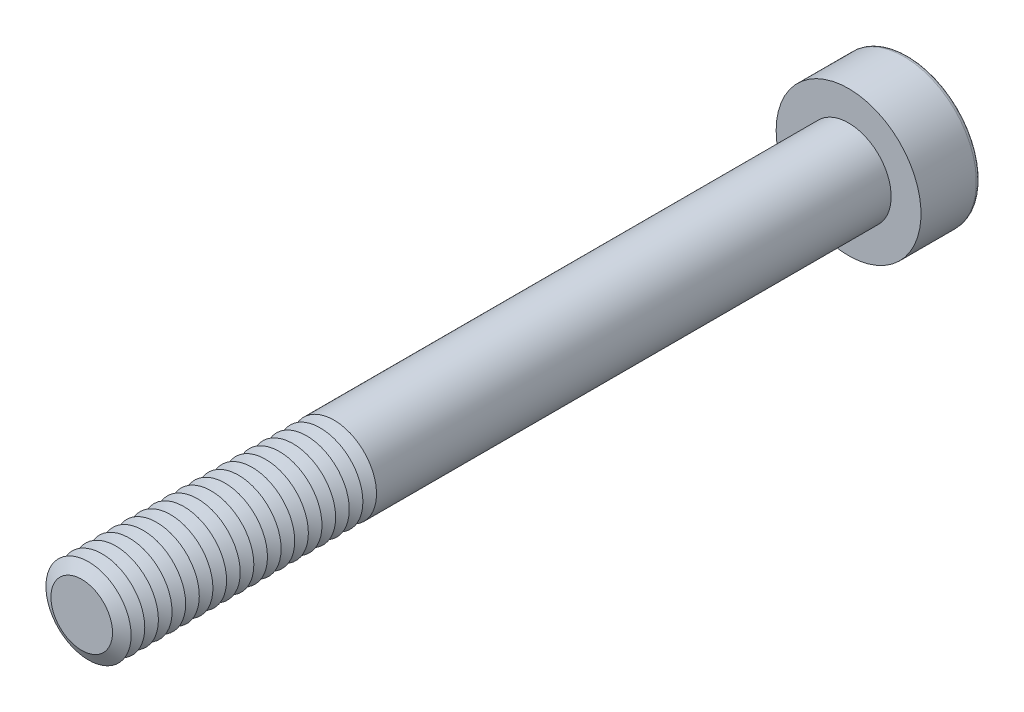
ISO-10303-21;
HEADER;
FILE_DESCRIPTION(('STEP AP214'),'2;1');
FILE_NAME('part.step','',(''),(''),'','','');
FILE_SCHEMA(('AUTOMOTIVE_DESIGN { 1 0 10303 214 1 1 1 1 }'));
ENDSEC;
DATA;
#1=APPLICATION_CONTEXT('core data for automotive mechanical design processes');
#2=APPLICATION_PROTOCOL_DEFINITION('international standard','automotive_design',2000,#1);
#3=PRODUCT_CONTEXT('',#1,'mechanical');
#4=PRODUCT('Part','Part','',(#3));
#5=PRODUCT_RELATED_PRODUCT_CATEGORY('part','',(#4));
#6=PRODUCT_DEFINITION_FORMATION('','',#4);
#7=PRODUCT_DEFINITION_CONTEXT('part definition',#1,'design');
#8=PRODUCT_DEFINITION('design','',#6,#7);
#9=PRODUCT_DEFINITION_SHAPE('','',#8);
#10=(LENGTH_UNIT() NAMED_UNIT(*) SI_UNIT(.MILLI.,.METRE.));
#11=(NAMED_UNIT(*) PLANE_ANGLE_UNIT() SI_UNIT($,.RADIAN.));
#12=(NAMED_UNIT(*) SI_UNIT($,.STERADIAN.) SOLID_ANGLE_UNIT());
#13=UNCERTAINTY_MEASURE_WITH_UNIT(LENGTH_MEASURE(1.E-05),#10,'distance_accuracy_value','');
#14=(GEOMETRIC_REPRESENTATION_CONTEXT(3) GLOBAL_UNCERTAINTY_ASSIGNED_CONTEXT((#13)) GLOBAL_UNIT_ASSIGNED_CONTEXT((#10,
#11,#12)) REPRESENTATION_CONTEXT('',''));
#15=CARTESIAN_POINT('',(0.,0.,0.));
#16=DIRECTION('',(0.,0.,1.));
#17=DIRECTION('',(1.,0.,0.));
#18=AXIS2_PLACEMENT_3D('',#15,#16,#17);
#19=CARTESIAN_POINT('',(0.,0.,42.2));
#20=DIRECTION('',(0.,0.,1.));
#21=DIRECTION('',(1.,0.,0.));
#22=AXIS2_PLACEMENT_3D('',#19,#20,#21);
#23=CONICAL_SURFACE('',#22,2.5,1.04719755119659);
#24=CARTESIAN_POINT('',(0.,0.,41.8));
#25=DIRECTION('',(0.,0.,1.));
#26=DIRECTION('',(1.,0.,0.));
#27=AXIS2_PLACEMENT_3D('',#24,#25,#26);
#28=CIRCLE('',#27,1.80717967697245);
#29=CARTESIAN_POINT('',(1.80717967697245,0.,41.8));
#30=VERTEX_POINT('',#29);
#31=EDGE_CURVE('E312',#30,#30,#28,.T.);
#32=ORIENTED_EDGE('',*,*,#31,.T.);
#33=EDGE_LOOP('',(#32));
#34=FACE_BOUND('',#33,.T.);
#35=CARTESIAN_POINT('',(0.,0.,42.2));
#36=DIRECTION('',(0.,0.,1.));
#37=DIRECTION('',(1.,0.,0.));
#38=AXIS2_PLACEMENT_3D('',#35,#36,#37);
#39=CIRCLE('',#38,2.5);
#40=CARTESIAN_POINT('',(2.5,0.,42.2));
#41=VERTEX_POINT('',#40);
#42=EDGE_CURVE('E315',#41,#41,#39,.T.);
#43=ORIENTED_EDGE('',*,*,#42,.F.);
#44=EDGE_LOOP('',(#43));
#45=FACE_BOUND('',#44,.T.);
#46=ADVANCED_FACE('F39',(#34,#45),#23,.T.);
#47=CARTESIAN_POINT('',(0.,0.,41.8));
#48=DIRECTION('',(0.,0.,-1.));
#49=DIRECTION('',(-1.,0.,0.));
#50=AXIS2_PLACEMENT_3D('',#47,#48,#49);
#51=CONICAL_SURFACE('',#50,1.80717967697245,1.0471975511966);
#52=CARTESIAN_POINT('',(0.,0.,41.4));
#53=DIRECTION('',(0.,0.,1.));
#54=DIRECTION('',(1.,0.,0.));
#55=AXIS2_PLACEMENT_3D('',#52,#53,#54);
#56=CIRCLE('',#55,2.5);
#57=CARTESIAN_POINT('',(2.5,0.,41.4));
#58=VERTEX_POINT('',#57);
#59=EDGE_CURVE('E323',#58,#58,#56,.T.);
#60=ORIENTED_EDGE('',*,*,#59,.T.);
#61=EDGE_LOOP('',(#60));
#62=FACE_BOUND('',#61,.T.);
#63=ORIENTED_EDGE('',*,*,#31,.F.);
#64=EDGE_LOOP('',(#63));
#65=FACE_BOUND('',#64,.T.);
#66=ADVANCED_FACE('F244',(#62,#65),#51,.T.);
#67=CARTESIAN_POINT('',(0.,0.,45.));
#68=DIRECTION('',(0.,0.,1.));
#69=DIRECTION('',(1.,0.,0.));
#70=AXIS2_PLACEMENT_3D('',#67,#68,#69);
#71=PLANE('',#70);
#72=CARTESIAN_POINT('',(0.,0.,45.));
#73=DIRECTION('',(0.,0.,1.));
#74=DIRECTION('',(1.,0.,0.));
#75=AXIS2_PLACEMENT_3D('',#72,#73,#74);
#76=CIRCLE('',#75,1.80717967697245);
#77=CARTESIAN_POINT('',(1.80717967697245,0.,45.));
#78=VERTEX_POINT('',#77);
#79=EDGE_CURVE('E173',#78,#78,#76,.T.);
#80=ORIENTED_EDGE('',*,*,#79,.T.);
#81=EDGE_LOOP('',(#80));
#82=FACE_BOUND('',#81,.T.);
#83=ADVANCED_FACE('F250',(#82),#71,.T.);
#84=CARTESIAN_POINT('',(0.,0.,45.));
#85=DIRECTION('',(0.,0.,-1.));
#86=DIRECTION('',(-1.,0.,0.));
#87=AXIS2_PLACEMENT_3D('',#84,#85,#86);
#88=CONICAL_SURFACE('',#87,1.80717967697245,1.0471975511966);
#89=CARTESIAN_POINT('',(0.,0.,44.6));
#90=DIRECTION('',(0.,0.,1.));
#91=DIRECTION('',(1.,0.,0.));
#92=AXIS2_PLACEMENT_3D('',#89,#90,#91);
#93=CIRCLE('',#92,2.5);
#94=CARTESIAN_POINT('',(2.5,0.,44.6));
#95=VERTEX_POINT('',#94);
#96=EDGE_CURVE('E290',#95,#95,#93,.T.);
#97=ORIENTED_EDGE('',*,*,#96,.T.);
#98=EDGE_LOOP('',(#97));
#99=FACE_BOUND('',#98,.T.);
#100=ORIENTED_EDGE('',*,*,#79,.F.);
#101=EDGE_LOOP('',(#100));
#102=FACE_BOUND('',#101,.T.);
#103=ADVANCED_FACE('F198',(#99,#102),#88,.T.);
#104=CARTESIAN_POINT('',(0.,0.,44.6));
#105=DIRECTION('',(0.,0.,1.));
#106=DIRECTION('',(1.,0.,0.));
#107=AXIS2_PLACEMENT_3D('',#104,#105,#106);
#108=CONICAL_SURFACE('',#107,2.5,1.04719755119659);
#109=CARTESIAN_POINT('',(0.,0.,44.2));
#110=DIRECTION('',(0.,0.,1.));
#111=DIRECTION('',(1.,0.,0.));
#112=AXIS2_PLACEMENT_3D('',#109,#110,#111);
#113=CIRCLE('',#112,1.80717967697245);
#114=CARTESIAN_POINT('',(1.80717967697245,0.,44.2));
#115=VERTEX_POINT('',#114);
#116=EDGE_CURVE('E287',#115,#115,#113,.T.);
#117=ORIENTED_EDGE('',*,*,#116,.T.);
#118=EDGE_LOOP('',(#117));
#119=FACE_BOUND('',#118,.T.);
#120=ORIENTED_EDGE('',*,*,#96,.F.);
#121=EDGE_LOOP('',(#120));
#122=FACE_BOUND('',#121,.T.);
#123=ADVANCED_FACE('F276',(#119,#122),#108,.T.);
#124=CARTESIAN_POINT('',(0.,0.,44.2));
#125=DIRECTION('',(0.,0.,-1.));
#126=DIRECTION('',(-1.,0.,0.));
#127=AXIS2_PLACEMENT_3D('',#124,#125,#126);
#128=CONICAL_SURFACE('',#127,1.80717967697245,1.0471975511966);
#129=CARTESIAN_POINT('',(0.,0.,43.8));
#130=DIRECTION('',(0.,0.,1.));
#131=DIRECTION('',(1.,0.,0.));
#132=AXIS2_PLACEMENT_3D('',#129,#130,#131);
#133=CIRCLE('',#132,2.5);
#134=CARTESIAN_POINT('',(2.5,0.,43.8));
#135=VERTEX_POINT('',#134);
#136=EDGE_CURVE('E299',#135,#135,#133,.T.);
#137=ORIENTED_EDGE('',*,*,#136,.T.);
#138=EDGE_LOOP('',(#137));
#139=FACE_BOUND('',#138,.T.);
#140=ORIENTED_EDGE('',*,*,#116,.F.);
#141=EDGE_LOOP('',(#140));
#142=FACE_BOUND('',#141,.T.);
#143=ADVANCED_FACE('F273',(#139,#142),#128,.T.);
#144=CARTESIAN_POINT('',(0.,0.,43.8));
#145=DIRECTION('',(0.,0.,1.));
#146=DIRECTION('',(1.,0.,0.));
#147=AXIS2_PLACEMENT_3D('',#144,#145,#146);
#148=CONICAL_SURFACE('',#147,2.5,1.04719755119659);
#149=CARTESIAN_POINT('',(0.,0.,43.4));
#150=DIRECTION('',(0.,0.,1.));
#151=DIRECTION('',(1.,0.,0.));
#152=AXIS2_PLACEMENT_3D('',#149,#150,#151);
#153=CIRCLE('',#152,1.80717967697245);
#154=CARTESIAN_POINT('',(1.80717967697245,0.,43.4));
#155=VERTEX_POINT('',#154);
#156=EDGE_CURVE('E292',#155,#155,#153,.T.);
#157=ORIENTED_EDGE('',*,*,#156,.T.);
#158=EDGE_LOOP('',(#157));
#159=FACE_BOUND('',#158,.T.);
#160=ORIENTED_EDGE('',*,*,#136,.F.);
#161=EDGE_LOOP('',(#160));
#162=FACE_BOUND('',#161,.T.);
#163=ADVANCED_FACE('F269',(#159,#162),#148,.T.);
#164=CARTESIAN_POINT('',(0.,0.,43.4));
#165=DIRECTION('',(0.,0.,-1.));
#166=DIRECTION('',(-1.,0.,0.));
#167=AXIS2_PLACEMENT_3D('',#164,#165,#166);
#168=CONICAL_SURFACE('',#167,1.80717967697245,1.0471975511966);
#169=CARTESIAN_POINT('',(0.,0.,43.));
#170=DIRECTION('',(0.,0.,1.));
#171=DIRECTION('',(1.,0.,0.));
#172=AXIS2_PLACEMENT_3D('',#169,#170,#171);
#173=CIRCLE('',#172,2.5);
#174=CARTESIAN_POINT('',(2.5,0.,43.));
#175=VERTEX_POINT('',#174);
#176=EDGE_CURVE('E308',#175,#175,#173,.T.);
#177=ORIENTED_EDGE('',*,*,#176,.T.);
#178=EDGE_LOOP('',(#177));
#179=FACE_BOUND('',#178,.T.);
#180=ORIENTED_EDGE('',*,*,#156,.F.);
#181=EDGE_LOOP('',(#180));
#182=FACE_BOUND('',#181,.T.);
#183=ADVANCED_FACE('F265',(#179,#182),#168,.T.);
#184=CARTESIAN_POINT('',(0.,0.,43.));
#185=DIRECTION('',(0.,0.,1.));
#186=DIRECTION('',(1.,0.,0.));
#187=AXIS2_PLACEMENT_3D('',#184,#185,#186);
#188=CONICAL_SURFACE('',#187,2.5,1.04719755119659);
#189=CARTESIAN_POINT('',(0.,0.,42.6));
#190=DIRECTION('',(0.,0.,1.));
#191=DIRECTION('',(1.,0.,0.));
#192=AXIS2_PLACEMENT_3D('',#189,#190,#191);
#193=CIRCLE('',#192,1.80717967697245);
#194=CARTESIAN_POINT('',(1.80717967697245,0.,42.6));
#195=VERTEX_POINT('',#194);
#196=EDGE_CURVE('E305',#195,#195,#193,.T.);
#197=ORIENTED_EDGE('',*,*,#196,.T.);
#198=EDGE_LOOP('',(#197));
#199=FACE_BOUND('',#198,.T.);
#200=ORIENTED_EDGE('',*,*,#176,.F.);
#201=EDGE_LOOP('',(#200));
#202=FACE_BOUND('',#201,.T.);
#203=ADVANCED_FACE('F261',(#199,#202),#188,.T.);
#204=CARTESIAN_POINT('',(0.,0.,42.6));
#205=DIRECTION('',(0.,0.,-1.));
#206=DIRECTION('',(-1.,0.,0.));
#207=AXIS2_PLACEMENT_3D('',#204,#205,#206);
#208=CONICAL_SURFACE('',#207,1.80717967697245,1.0471975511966);
#209=ORIENTED_EDGE('',*,*,#42,.T.);
#210=EDGE_LOOP('',(#209));
#211=FACE_BOUND('',#210,.T.);
#212=ORIENTED_EDGE('',*,*,#196,.F.);
#213=EDGE_LOOP('',(#212));
#214=FACE_BOUND('',#213,.T.);
#215=ADVANCED_FACE('F257',(#211,#214),#208,.T.);
#216=CARTESIAN_POINT('',(0.,0.,41.4));
#217=DIRECTION('',(0.,0.,1.));
#218=DIRECTION('',(1.,0.,0.));
#219=AXIS2_PLACEMENT_3D('',#216,#217,#218);
#220=CONICAL_SURFACE('',#219,2.5,1.04719755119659);
#221=CARTESIAN_POINT('',(0.,0.,41.));
#222=DIRECTION('',(0.,0.,1.));
#223=DIRECTION('',(1.,0.,0.));
#224=AXIS2_PLACEMENT_3D('',#221,#222,#223);
#225=CIRCLE('',#224,1.80717967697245);
#226=CARTESIAN_POINT('',(1.80717967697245,0.,41.));
#227=VERTEX_POINT('',#226);
#228=EDGE_CURVE('E319',#227,#227,#225,.T.);
#229=ORIENTED_EDGE('',*,*,#228,.T.);
#230=EDGE_LOOP('',(#229));
#231=FACE_BOUND('',#230,.T.);
#232=ORIENTED_EDGE('',*,*,#59,.F.);
#233=EDGE_LOOP('',(#232));
#234=FACE_BOUND('',#233,.T.);
#235=ADVANCED_FACE('F260',(#231,#234),#220,.T.);
#236=CARTESIAN_POINT('',(0.,0.,41.));
#237=DIRECTION('',(0.,0.,-1.));
#238=DIRECTION('',(-1.,0.,0.));
#239=AXIS2_PLACEMENT_3D('',#236,#237,#238);
#240=CONICAL_SURFACE('',#239,1.80717967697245,1.0471975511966);
#241=CARTESIAN_POINT('',(0.,0.,40.6));
#242=DIRECTION('',(0.,0.,1.));
#243=DIRECTION('',(1.,0.,0.));
#244=AXIS2_PLACEMENT_3D('',#241,#242,#243);
#245=CIRCLE('',#244,2.5);
#246=CARTESIAN_POINT('',(2.5,0.,40.6));
#247=VERTEX_POINT('',#246);
#248=EDGE_CURVE('E331',#247,#247,#245,.T.);
#249=ORIENTED_EDGE('',*,*,#248,.T.);
#250=EDGE_LOOP('',(#249));
#251=FACE_BOUND('',#250,.T.);
#252=ORIENTED_EDGE('',*,*,#228,.F.);
#253=EDGE_LOOP('',(#252));
#254=FACE_BOUND('',#253,.T.);
#255=ADVANCED_FACE('F543',(#251,#254),#240,.T.);
#256=CARTESIAN_POINT('',(0.,0.,40.6));
#257=DIRECTION('',(0.,0.,1.));
#258=DIRECTION('',(1.,0.,0.));
#259=AXIS2_PLACEMENT_3D('',#256,#257,#258);
#260=CONICAL_SURFACE('',#259,2.5,1.04719755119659);
#261=CARTESIAN_POINT('',(0.,0.,40.2));
#262=DIRECTION('',(0.,0.,1.));
#263=DIRECTION('',(1.,0.,0.));
#264=AXIS2_PLACEMENT_3D('',#261,#262,#263);
#265=CIRCLE('',#264,1.80717967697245);
#266=CARTESIAN_POINT('',(1.80717967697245,0.,40.2));
#267=VERTEX_POINT('',#266);
#268=EDGE_CURVE('E327',#267,#267,#265,.T.);
#269=ORIENTED_EDGE('',*,*,#268,.T.);
#270=EDGE_LOOP('',(#269));
#271=FACE_BOUND('',#270,.T.);
#272=ORIENTED_EDGE('',*,*,#248,.F.);
#273=EDGE_LOOP('',(#272));
#274=FACE_BOUND('',#273,.T.);
#275=ADVANCED_FACE('F539',(#271,#274),#260,.T.);
#276=CARTESIAN_POINT('',(0.,0.,40.2));
#277=DIRECTION('',(0.,0.,-1.));
#278=DIRECTION('',(-1.,0.,0.));
#279=AXIS2_PLACEMENT_3D('',#276,#277,#278);
#280=CONICAL_SURFACE('',#279,1.80717967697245,1.0471975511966);
#281=CARTESIAN_POINT('',(0.,0.,39.8));
#282=DIRECTION('',(0.,0.,1.));
#283=DIRECTION('',(1.,0.,0.));
#284=AXIS2_PLACEMENT_3D('',#281,#282,#283);
#285=CIRCLE('',#284,2.5);
#286=CARTESIAN_POINT('',(2.5,0.,39.8));
#287=VERTEX_POINT('',#286);
#288=EDGE_CURVE('E339',#287,#287,#285,.T.);
#289=ORIENTED_EDGE('',*,*,#288,.T.);
#290=EDGE_LOOP('',(#289));
#291=FACE_BOUND('',#290,.T.);
#292=ORIENTED_EDGE('',*,*,#268,.F.);
#293=EDGE_LOOP('',(#292));
#294=FACE_BOUND('',#293,.T.);
#295=ADVANCED_FACE('F535',(#291,#294),#280,.T.);
#296=CARTESIAN_POINT('',(0.,0.,39.8));
#297=DIRECTION('',(0.,0.,1.));
#298=DIRECTION('',(1.,0.,0.));
#299=AXIS2_PLACEMENT_3D('',#296,#297,#298);
#300=CONICAL_SURFACE('',#299,2.5,1.04719755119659);
#301=CARTESIAN_POINT('',(0.,0.,39.4));
#302=DIRECTION('',(0.,0.,1.));
#303=DIRECTION('',(1.,0.,0.));
#304=AXIS2_PLACEMENT_3D('',#301,#302,#303);
#305=CIRCLE('',#304,1.80717967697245);
#306=CARTESIAN_POINT('',(1.80717967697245,0.,39.4));
#307=VERTEX_POINT('',#306);
#308=EDGE_CURVE('E335',#307,#307,#305,.T.);
#309=ORIENTED_EDGE('',*,*,#308,.T.);
#310=EDGE_LOOP('',(#309));
#311=FACE_BOUND('',#310,.T.);
#312=ORIENTED_EDGE('',*,*,#288,.F.);
#313=EDGE_LOOP('',(#312));
#314=FACE_BOUND('',#313,.T.);
#315=ADVANCED_FACE('F531',(#311,#314),#300,.T.);
#316=CARTESIAN_POINT('',(0.,0.,39.4));
#317=DIRECTION('',(0.,0.,-1.));
#318=DIRECTION('',(-1.,0.,0.));
#319=AXIS2_PLACEMENT_3D('',#316,#317,#318);
#320=CONICAL_SURFACE('',#319,1.80717967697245,1.0471975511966);
#321=CARTESIAN_POINT('',(0.,0.,39.));
#322=DIRECTION('',(0.,0.,1.));
#323=DIRECTION('',(1.,0.,0.));
#324=AXIS2_PLACEMENT_3D('',#321,#322,#323);
#325=CIRCLE('',#324,2.5);
#326=CARTESIAN_POINT('',(2.5,0.,39.));
#327=VERTEX_POINT('',#326);
#328=EDGE_CURVE('E346',#327,#327,#325,.T.);
#329=ORIENTED_EDGE('',*,*,#328,.T.);
#330=EDGE_LOOP('',(#329));
#331=FACE_BOUND('',#330,.T.);
#332=ORIENTED_EDGE('',*,*,#308,.F.);
#333=EDGE_LOOP('',(#332));
#334=FACE_BOUND('',#333,.T.);
#335=ADVANCED_FACE('F527',(#331,#334),#320,.T.);
#336=CARTESIAN_POINT('',(0.,0.,39.));
#337=DIRECTION('',(0.,0.,1.));
#338=DIRECTION('',(1.,0.,0.));
#339=AXIS2_PLACEMENT_3D('',#336,#337,#338);
#340=CONICAL_SURFACE('',#339,2.5,1.04719755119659);
#341=CARTESIAN_POINT('',(0.,0.,38.6));
#342=DIRECTION('',(0.,0.,1.));
#343=DIRECTION('',(1.,0.,0.));
#344=AXIS2_PLACEMENT_3D('',#341,#342,#343);
#345=CIRCLE('',#344,1.80717967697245);
#346=CARTESIAN_POINT('',(1.80717967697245,0.,38.6));
#347=VERTEX_POINT('',#346);
#348=EDGE_CURVE('E342',#347,#347,#345,.T.);
#349=ORIENTED_EDGE('',*,*,#348,.T.);
#350=EDGE_LOOP('',(#349));
#351=FACE_BOUND('',#350,.T.);
#352=ORIENTED_EDGE('',*,*,#328,.F.);
#353=EDGE_LOOP('',(#352));
#354=FACE_BOUND('',#353,.T.);
#355=ADVANCED_FACE('F523',(#351,#354),#340,.T.);
#356=CARTESIAN_POINT('',(0.,0.,38.6));
#357=DIRECTION('',(0.,0.,-1.));
#358=DIRECTION('',(-1.,0.,0.));
#359=AXIS2_PLACEMENT_3D('',#356,#357,#358);
#360=CONICAL_SURFACE('',#359,1.80717967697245,1.0471975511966);
#361=CARTESIAN_POINT('',(0.,0.,38.2));
#362=DIRECTION('',(0.,0.,1.));
#363=DIRECTION('',(1.,0.,0.));
#364=AXIS2_PLACEMENT_3D('',#361,#362,#363);
#365=CIRCLE('',#364,2.5);
#366=CARTESIAN_POINT('',(2.5,0.,38.2));
#367=VERTEX_POINT('',#366);
#368=EDGE_CURVE('E354',#367,#367,#365,.T.);
#369=ORIENTED_EDGE('',*,*,#368,.T.);
#370=EDGE_LOOP('',(#369));
#371=FACE_BOUND('',#370,.T.);
#372=ORIENTED_EDGE('',*,*,#348,.F.);
#373=EDGE_LOOP('',(#372));
#374=FACE_BOUND('',#373,.T.);
#375=ADVANCED_FACE('F519',(#371,#374),#360,.T.);
#376=CARTESIAN_POINT('',(0.,0.,38.2));
#377=DIRECTION('',(0.,0.,1.));
#378=DIRECTION('',(1.,0.,0.));
#379=AXIS2_PLACEMENT_3D('',#376,#377,#378);
#380=CONICAL_SURFACE('',#379,2.5,1.04719755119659);
#381=CARTESIAN_POINT('',(0.,0.,37.8));
#382=DIRECTION('',(0.,0.,1.));
#383=DIRECTION('',(1.,0.,0.));
#384=AXIS2_PLACEMENT_3D('',#381,#382,#383);
#385=CIRCLE('',#384,1.80717967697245);
#386=CARTESIAN_POINT('',(1.80717967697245,0.,37.8));
#387=VERTEX_POINT('',#386);
#388=EDGE_CURVE('E350',#387,#387,#385,.T.);
#389=ORIENTED_EDGE('',*,*,#388,.T.);
#390=EDGE_LOOP('',(#389));
#391=FACE_BOUND('',#390,.T.);
#392=ORIENTED_EDGE('',*,*,#368,.F.);
#393=EDGE_LOOP('',(#392));
#394=FACE_BOUND('',#393,.T.);
#395=ADVANCED_FACE('F515',(#391,#394),#380,.T.);
#396=CARTESIAN_POINT('',(0.,0.,37.8));
#397=DIRECTION('',(0.,0.,-1.));
#398=DIRECTION('',(-1.,0.,0.));
#399=AXIS2_PLACEMENT_3D('',#396,#397,#398);
#400=CONICAL_SURFACE('',#399,1.80717967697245,1.0471975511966);
#401=CARTESIAN_POINT('',(0.,0.,37.4));
#402=DIRECTION('',(0.,0.,1.));
#403=DIRECTION('',(1.,0.,0.));
#404=AXIS2_PLACEMENT_3D('',#401,#402,#403);
#405=CIRCLE('',#404,2.5);
#406=CARTESIAN_POINT('',(2.5,0.,37.4));
#407=VERTEX_POINT('',#406);
#408=EDGE_CURVE('E362',#407,#407,#405,.T.);
#409=ORIENTED_EDGE('',*,*,#408,.T.);
#410=EDGE_LOOP('',(#409));
#411=FACE_BOUND('',#410,.T.);
#412=ORIENTED_EDGE('',*,*,#388,.F.);
#413=EDGE_LOOP('',(#412));
#414=FACE_BOUND('',#413,.T.);
#415=ADVANCED_FACE('F511',(#411,#414),#400,.T.);
#416=CARTESIAN_POINT('',(0.,0.,37.4));
#417=DIRECTION('',(0.,0.,1.));
#418=DIRECTION('',(1.,0.,0.));
#419=AXIS2_PLACEMENT_3D('',#416,#417,#418);
#420=CONICAL_SURFACE('',#419,2.5,1.04719755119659);
#421=CARTESIAN_POINT('',(0.,0.,37.));
#422=DIRECTION('',(0.,0.,1.));
#423=DIRECTION('',(1.,0.,0.));
#424=AXIS2_PLACEMENT_3D('',#421,#422,#423);
#425=CIRCLE('',#424,1.80717967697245);
#426=CARTESIAN_POINT('',(1.80717967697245,0.,37.));
#427=VERTEX_POINT('',#426);
#428=EDGE_CURVE('E358',#427,#427,#425,.T.);
#429=ORIENTED_EDGE('',*,*,#428,.T.);
#430=EDGE_LOOP('',(#429));
#431=FACE_BOUND('',#430,.T.);
#432=ORIENTED_EDGE('',*,*,#408,.F.);
#433=EDGE_LOOP('',(#432));
#434=FACE_BOUND('',#433,.T.);
#435=ADVANCED_FACE('F507',(#431,#434),#420,.T.);
#436=CARTESIAN_POINT('',(0.,0.,37.));
#437=DIRECTION('',(0.,0.,-1.));
#438=DIRECTION('',(-1.,0.,0.));
#439=AXIS2_PLACEMENT_3D('',#436,#437,#438);
#440=CONICAL_SURFACE('',#439,1.80717967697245,1.0471975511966);
#441=CARTESIAN_POINT('',(0.,0.,36.6));
#442=DIRECTION('',(0.,0.,1.));
#443=DIRECTION('',(1.,0.,0.));
#444=AXIS2_PLACEMENT_3D('',#441,#442,#443);
#445=CIRCLE('',#444,2.5);
#446=CARTESIAN_POINT('',(2.5,0.,36.6));
#447=VERTEX_POINT('',#446);
#448=EDGE_CURVE('E370',#447,#447,#445,.T.);
#449=ORIENTED_EDGE('',*,*,#448,.T.);
#450=EDGE_LOOP('',(#449));
#451=FACE_BOUND('',#450,.T.);
#452=ORIENTED_EDGE('',*,*,#428,.F.);
#453=EDGE_LOOP('',(#452));
#454=FACE_BOUND('',#453,.T.);
#455=ADVANCED_FACE('F503',(#451,#454),#440,.T.);
#456=CARTESIAN_POINT('',(0.,0.,36.6));
#457=DIRECTION('',(0.,0.,1.));
#458=DIRECTION('',(1.,0.,0.));
#459=AXIS2_PLACEMENT_3D('',#456,#457,#458);
#460=CONICAL_SURFACE('',#459,2.5,1.04719755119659);
#461=CARTESIAN_POINT('',(0.,0.,36.2));
#462=DIRECTION('',(0.,0.,1.));
#463=DIRECTION('',(1.,0.,0.));
#464=AXIS2_PLACEMENT_3D('',#461,#462,#463);
#465=CIRCLE('',#464,1.80717967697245);
#466=CARTESIAN_POINT('',(1.80717967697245,0.,36.2));
#467=VERTEX_POINT('',#466);
#468=EDGE_CURVE('E366',#467,#467,#465,.T.);
#469=ORIENTED_EDGE('',*,*,#468,.T.);
#470=EDGE_LOOP('',(#469));
#471=FACE_BOUND('',#470,.T.);
#472=ORIENTED_EDGE('',*,*,#448,.F.);
#473=EDGE_LOOP('',(#472));
#474=FACE_BOUND('',#473,.T.);
#475=ADVANCED_FACE('F499',(#471,#474),#460,.T.);
#476=CARTESIAN_POINT('',(0.,0.,36.2));
#477=DIRECTION('',(0.,0.,-1.));
#478=DIRECTION('',(-1.,0.,0.));
#479=AXIS2_PLACEMENT_3D('',#476,#477,#478);
#480=CONICAL_SURFACE('',#479,1.80717967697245,1.0471975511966);
#481=CARTESIAN_POINT('',(0.,0.,35.8));
#482=DIRECTION('',(0.,0.,1.));
#483=DIRECTION('',(1.,0.,0.));
#484=AXIS2_PLACEMENT_3D('',#481,#482,#483);
#485=CIRCLE('',#484,2.5);
#486=CARTESIAN_POINT('',(2.5,0.,35.8));
#487=VERTEX_POINT('',#486);
#488=EDGE_CURVE('E378',#487,#487,#485,.T.);
#489=ORIENTED_EDGE('',*,*,#488,.T.);
#490=EDGE_LOOP('',(#489));
#491=FACE_BOUND('',#490,.T.);
#492=ORIENTED_EDGE('',*,*,#468,.F.);
#493=EDGE_LOOP('',(#492));
#494=FACE_BOUND('',#493,.T.);
#495=ADVANCED_FACE('F495',(#491,#494),#480,.T.);
#496=CARTESIAN_POINT('',(0.,0.,35.8));
#497=DIRECTION('',(0.,0.,1.));
#498=DIRECTION('',(1.,0.,0.));
#499=AXIS2_PLACEMENT_3D('',#496,#497,#498);
#500=CONICAL_SURFACE('',#499,2.5,1.04719755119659);
#501=CARTESIAN_POINT('',(0.,0.,35.4));
#502=DIRECTION('',(0.,0.,1.));
#503=DIRECTION('',(1.,0.,0.));
#504=AXIS2_PLACEMENT_3D('',#501,#502,#503);
#505=CIRCLE('',#504,1.80717967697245);
#506=CARTESIAN_POINT('',(1.80717967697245,0.,35.4));
#507=VERTEX_POINT('',#506);
#508=EDGE_CURVE('E374',#507,#507,#505,.T.);
#509=ORIENTED_EDGE('',*,*,#508,.T.);
#510=EDGE_LOOP('',(#509));
#511=FACE_BOUND('',#510,.T.);
#512=ORIENTED_EDGE('',*,*,#488,.F.);
#513=EDGE_LOOP('',(#512));
#514=FACE_BOUND('',#513,.T.);
#515=ADVANCED_FACE('F491',(#511,#514),#500,.T.);
#516=CARTESIAN_POINT('',(0.,0.,35.4));
#517=DIRECTION('',(0.,0.,-1.));
#518=DIRECTION('',(-1.,0.,0.));
#519=AXIS2_PLACEMENT_3D('',#516,#517,#518);
#520=CONICAL_SURFACE('',#519,1.80717967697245,1.0471975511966);
#521=CARTESIAN_POINT('',(0.,0.,35.));
#522=DIRECTION('',(0.,0.,1.));
#523=DIRECTION('',(1.,0.,0.));
#524=AXIS2_PLACEMENT_3D('',#521,#522,#523);
#525=CIRCLE('',#524,2.5);
#526=CARTESIAN_POINT('',(2.5,0.,35.));
#527=VERTEX_POINT('',#526);
#528=EDGE_CURVE('E386',#527,#527,#525,.T.);
#529=ORIENTED_EDGE('',*,*,#528,.T.);
#530=EDGE_LOOP('',(#529));
#531=FACE_BOUND('',#530,.T.);
#532=ORIENTED_EDGE('',*,*,#508,.F.);
#533=EDGE_LOOP('',(#532));
#534=FACE_BOUND('',#533,.T.);
#535=ADVANCED_FACE('F487',(#531,#534),#520,.T.);
#536=CARTESIAN_POINT('',(0.,0.,35.));
#537=DIRECTION('',(0.,0.,1.));
#538=DIRECTION('',(1.,0.,0.));
#539=AXIS2_PLACEMENT_3D('',#536,#537,#538);
#540=CONICAL_SURFACE('',#539,2.5,1.04719755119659);
#541=CARTESIAN_POINT('',(0.,0.,34.6));
#542=DIRECTION('',(0.,0.,1.));
#543=DIRECTION('',(1.,0.,0.));
#544=AXIS2_PLACEMENT_3D('',#541,#542,#543);
#545=CIRCLE('',#544,1.80717967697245);
#546=CARTESIAN_POINT('',(1.80717967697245,0.,34.6));
#547=VERTEX_POINT('',#546);
#548=EDGE_CURVE('E382',#547,#547,#545,.T.);
#549=ORIENTED_EDGE('',*,*,#548,.T.);
#550=EDGE_LOOP('',(#549));
#551=FACE_BOUND('',#550,.T.);
#552=ORIENTED_EDGE('',*,*,#528,.F.);
#553=EDGE_LOOP('',(#552));
#554=FACE_BOUND('',#553,.T.);
#555=ADVANCED_FACE('F483',(#551,#554),#540,.T.);
#556=CARTESIAN_POINT('',(0.,0.,34.6));
#557=DIRECTION('',(0.,0.,-1.));
#558=DIRECTION('',(-1.,0.,0.));
#559=AXIS2_PLACEMENT_3D('',#556,#557,#558);
#560=CONICAL_SURFACE('',#559,1.80717967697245,1.0471975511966);
#561=CARTESIAN_POINT('',(0.,0.,34.2));
#562=DIRECTION('',(0.,0.,1.));
#563=DIRECTION('',(1.,0.,0.));
#564=AXIS2_PLACEMENT_3D('',#561,#562,#563);
#565=CIRCLE('',#564,2.5);
#566=CARTESIAN_POINT('',(2.5,0.,34.2));
#567=VERTEX_POINT('',#566);
#568=EDGE_CURVE('E394',#567,#567,#565,.T.);
#569=ORIENTED_EDGE('',*,*,#568,.T.);
#570=EDGE_LOOP('',(#569));
#571=FACE_BOUND('',#570,.T.);
#572=ORIENTED_EDGE('',*,*,#548,.F.);
#573=EDGE_LOOP('',(#572));
#574=FACE_BOUND('',#573,.T.);
#575=ADVANCED_FACE('F479',(#571,#574),#560,.T.);
#576=CARTESIAN_POINT('',(0.,0.,34.2));
#577=DIRECTION('',(0.,0.,1.));
#578=DIRECTION('',(1.,0.,0.));
#579=AXIS2_PLACEMENT_3D('',#576,#577,#578);
#580=CONICAL_SURFACE('',#579,2.5,1.04719755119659);
#581=CARTESIAN_POINT('',(0.,0.,33.8));
#582=DIRECTION('',(0.,0.,1.));
#583=DIRECTION('',(1.,0.,0.));
#584=AXIS2_PLACEMENT_3D('',#581,#582,#583);
#585=CIRCLE('',#584,1.80717967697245);
#586=CARTESIAN_POINT('',(1.80717967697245,0.,33.8));
#587=VERTEX_POINT('',#586);
#588=EDGE_CURVE('E390',#587,#587,#585,.T.);
#589=ORIENTED_EDGE('',*,*,#588,.T.);
#590=EDGE_LOOP('',(#589));
#591=FACE_BOUND('',#590,.T.);
#592=ORIENTED_EDGE('',*,*,#568,.F.);
#593=EDGE_LOOP('',(#592));
#594=FACE_BOUND('',#593,.T.);
#595=ADVANCED_FACE('F475',(#591,#594),#580,.T.);
#596=CARTESIAN_POINT('',(0.,0.,33.8));
#597=DIRECTION('',(0.,0.,-1.));
#598=DIRECTION('',(-1.,0.,0.));
#599=AXIS2_PLACEMENT_3D('',#596,#597,#598);
#600=CONICAL_SURFACE('',#599,1.80717967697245,1.0471975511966);
#601=CARTESIAN_POINT('',(0.,0.,33.4));
#602=DIRECTION('',(0.,0.,1.));
#603=DIRECTION('',(1.,0.,0.));
#604=AXIS2_PLACEMENT_3D('',#601,#602,#603);
#605=CIRCLE('',#604,2.5);
#606=CARTESIAN_POINT('',(2.5,0.,33.4));
#607=VERTEX_POINT('',#606);
#608=EDGE_CURVE('E402',#607,#607,#605,.T.);
#609=ORIENTED_EDGE('',*,*,#608,.T.);
#610=EDGE_LOOP('',(#609));
#611=FACE_BOUND('',#610,.T.);
#612=ORIENTED_EDGE('',*,*,#588,.F.);
#613=EDGE_LOOP('',(#612));
#614=FACE_BOUND('',#613,.T.);
#615=ADVANCED_FACE('F471',(#611,#614),#600,.T.);
#616=CARTESIAN_POINT('',(0.,0.,33.4));
#617=DIRECTION('',(0.,0.,1.));
#618=DIRECTION('',(1.,0.,0.));
#619=AXIS2_PLACEMENT_3D('',#616,#617,#618);
#620=CONICAL_SURFACE('',#619,2.5,1.04719755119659);
#621=CARTESIAN_POINT('',(0.,0.,33.));
#622=DIRECTION('',(0.,0.,1.));
#623=DIRECTION('',(1.,0.,0.));
#624=AXIS2_PLACEMENT_3D('',#621,#622,#623);
#625=CIRCLE('',#624,1.80717967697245);
#626=CARTESIAN_POINT('',(1.80717967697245,0.,33.));
#627=VERTEX_POINT('',#626);
#628=EDGE_CURVE('E398',#627,#627,#625,.T.);
#629=ORIENTED_EDGE('',*,*,#628,.T.);
#630=EDGE_LOOP('',(#629));
#631=FACE_BOUND('',#630,.T.);
#632=ORIENTED_EDGE('',*,*,#608,.F.);
#633=EDGE_LOOP('',(#632));
#634=FACE_BOUND('',#633,.T.);
#635=ADVANCED_FACE('F467',(#631,#634),#620,.T.);
#636=CARTESIAN_POINT('',(0.,0.,33.));
#637=DIRECTION('',(0.,0.,-1.));
#638=DIRECTION('',(-1.,0.,0.));
#639=AXIS2_PLACEMENT_3D('',#636,#637,#638);
#640=CONICAL_SURFACE('',#639,1.80717967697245,1.0471975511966);
#641=CARTESIAN_POINT('',(0.,0.,32.6));
#642=DIRECTION('',(0.,0.,1.));
#643=DIRECTION('',(1.,0.,0.));
#644=AXIS2_PLACEMENT_3D('',#641,#642,#643);
#645=CIRCLE('',#644,2.5);
#646=CARTESIAN_POINT('',(2.5,0.,32.6));
#647=VERTEX_POINT('',#646);
#648=EDGE_CURVE('E410',#647,#647,#645,.T.);
#649=ORIENTED_EDGE('',*,*,#648,.T.);
#650=EDGE_LOOP('',(#649));
#651=FACE_BOUND('',#650,.T.);
#652=ORIENTED_EDGE('',*,*,#628,.F.);
#653=EDGE_LOOP('',(#652));
#654=FACE_BOUND('',#653,.T.);
#655=ADVANCED_FACE('F463',(#651,#654),#640,.T.);
#656=CARTESIAN_POINT('',(0.,0.,32.6));
#657=DIRECTION('',(0.,0.,1.));
#658=DIRECTION('',(1.,0.,0.));
#659=AXIS2_PLACEMENT_3D('',#656,#657,#658);
#660=CONICAL_SURFACE('',#659,2.5,1.04719755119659);
#661=CARTESIAN_POINT('',(0.,0.,32.2));
#662=DIRECTION('',(0.,0.,1.));
#663=DIRECTION('',(1.,0.,0.));
#664=AXIS2_PLACEMENT_3D('',#661,#662,#663);
#665=CIRCLE('',#664,1.80717967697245);
#666=CARTESIAN_POINT('',(1.80717967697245,0.,32.2));
#667=VERTEX_POINT('',#666);
#668=EDGE_CURVE('E406',#667,#667,#665,.T.);
#669=ORIENTED_EDGE('',*,*,#668,.T.);
#670=EDGE_LOOP('',(#669));
#671=FACE_BOUND('',#670,.T.);
#672=ORIENTED_EDGE('',*,*,#648,.F.);
#673=EDGE_LOOP('',(#672));
#674=FACE_BOUND('',#673,.T.);
#675=ADVANCED_FACE('F459',(#671,#674),#660,.T.);
#676=CARTESIAN_POINT('',(0.,0.,32.2));
#677=DIRECTION('',(0.,0.,-1.));
#678=DIRECTION('',(-1.,0.,0.));
#679=AXIS2_PLACEMENT_3D('',#676,#677,#678);
#680=CONICAL_SURFACE('',#679,1.80717967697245,1.0471975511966);
#681=CARTESIAN_POINT('',(0.,0.,31.8));
#682=DIRECTION('',(0.,0.,1.));
#683=DIRECTION('',(1.,0.,0.));
#684=AXIS2_PLACEMENT_3D('',#681,#682,#683);
#685=CIRCLE('',#684,2.5);
#686=CARTESIAN_POINT('',(2.5,0.,31.8));
#687=VERTEX_POINT('',#686);
#688=EDGE_CURVE('E418',#687,#687,#685,.T.);
#689=ORIENTED_EDGE('',*,*,#688,.T.);
#690=EDGE_LOOP('',(#689));
#691=FACE_BOUND('',#690,.T.);
#692=ORIENTED_EDGE('',*,*,#668,.F.);
#693=EDGE_LOOP('',(#692));
#694=FACE_BOUND('',#693,.T.);
#695=ADVANCED_FACE('F455',(#691,#694),#680,.T.);
#696=CARTESIAN_POINT('',(0.,0.,31.8));
#697=DIRECTION('',(0.,0.,1.));
#698=DIRECTION('',(1.,0.,0.));
#699=AXIS2_PLACEMENT_3D('',#696,#697,#698);
#700=CONICAL_SURFACE('',#699,2.5,1.04719755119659);
#701=CARTESIAN_POINT('',(0.,0.,31.4));
#702=DIRECTION('',(0.,0.,1.));
#703=DIRECTION('',(1.,0.,0.));
#704=AXIS2_PLACEMENT_3D('',#701,#702,#703);
#705=CIRCLE('',#704,1.80717967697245);
#706=CARTESIAN_POINT('',(1.80717967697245,0.,31.4));
#707=VERTEX_POINT('',#706);
#708=EDGE_CURVE('E414',#707,#707,#705,.T.);
#709=ORIENTED_EDGE('',*,*,#708,.T.);
#710=EDGE_LOOP('',(#709));
#711=FACE_BOUND('',#710,.T.);
#712=ORIENTED_EDGE('',*,*,#688,.F.);
#713=EDGE_LOOP('',(#712));
#714=FACE_BOUND('',#713,.T.);
#715=ADVANCED_FACE('F450',(#711,#714),#700,.T.);
#716=CARTESIAN_POINT('',(0.,0.,31.4));
#717=DIRECTION('',(0.,0.,-1.));
#718=DIRECTION('',(-1.,0.,0.));
#719=AXIS2_PLACEMENT_3D('',#716,#717,#718);
#720=CONICAL_SURFACE('',#719,1.80717967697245,1.0471975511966);
#721=CARTESIAN_POINT('',(0.,0.,31.));
#722=DIRECTION('',(0.,0.,1.));
#723=DIRECTION('',(1.,0.,0.));
#724=AXIS2_PLACEMENT_3D('',#721,#722,#723);
#725=CIRCLE('',#724,2.5);
#726=CARTESIAN_POINT('',(2.5,0.,31.));
#727=VERTEX_POINT('',#726);
#728=EDGE_CURVE('E430',#727,#727,#725,.T.);
#729=ORIENTED_EDGE('',*,*,#728,.T.);
#730=EDGE_LOOP('',(#729));
#731=FACE_BOUND('',#730,.T.);
#732=ORIENTED_EDGE('',*,*,#708,.F.);
#733=EDGE_LOOP('',(#732));
#734=FACE_BOUND('',#733,.T.);
#735=ADVANCED_FACE('F436',(#731,#734),#720,.T.);
#736=CARTESIAN_POINT('',(0.,0.,31.));
#737=DIRECTION('',(0.,0.,1.));
#738=DIRECTION('',(1.,0.,0.));
#739=AXIS2_PLACEMENT_3D('',#736,#737,#738);
#740=CONICAL_SURFACE('',#739,2.5,1.04719755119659);
#741=CARTESIAN_POINT('',(0.,0.,30.6));
#742=DIRECTION('',(0.,0.,1.));
#743=DIRECTION('',(1.,0.,0.));
#744=AXIS2_PLACEMENT_3D('',#741,#742,#743);
#745=CIRCLE('',#744,1.80717967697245);
#746=CARTESIAN_POINT('',(1.80717967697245,0.,30.6));
#747=VERTEX_POINT('',#746);
#748=EDGE_CURVE('E422',#747,#747,#745,.T.);
#749=ORIENTED_EDGE('',*,*,#748,.T.);
#750=EDGE_LOOP('',(#749));
#751=FACE_BOUND('',#750,.T.);
#752=ORIENTED_EDGE('',*,*,#728,.F.);
#753=EDGE_LOOP('',(#752));
#754=FACE_BOUND('',#753,.T.);
#755=ADVANCED_FACE('F439',(#751,#754),#740,.T.);
#756=CARTESIAN_POINT('',(0.,0.,30.6));
#757=DIRECTION('',(0.,0.,-1.));
#758=DIRECTION('',(-1.,0.,0.));
#759=AXIS2_PLACEMENT_3D('',#756,#757,#758);
#760=CONICAL_SURFACE('',#759,1.80717967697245,1.0471975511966);
#761=CARTESIAN_POINT('',(0.,0.,30.2));
#762=DIRECTION('',(0.,0.,1.));
#763=DIRECTION('',(1.,0.,0.));
#764=AXIS2_PLACEMENT_3D('',#761,#762,#763);
#765=CIRCLE('',#764,2.5);
#766=CARTESIAN_POINT('',(-2.5,0.,30.2));
#767=VERTEX_POINT('',#766);
#768=EDGE_CURVE('E426',#767,#767,#765,.T.);
#769=ORIENTED_EDGE('',*,*,#768,.T.);
#770=EDGE_LOOP('',(#769));
#771=FACE_BOUND('',#770,.T.);
#772=ORIENTED_EDGE('',*,*,#748,.F.);
#773=EDGE_LOOP('',(#772));
#774=FACE_BOUND('',#773,.T.);
#775=ADVANCED_FACE('F441',(#771,#774),#760,.T.);
#776=CARTESIAN_POINT('',(0.,0.,-1.25));
#777=DIRECTION('',(0.,0.,-1.));
#778=DIRECTION('',(-1.,0.,0.));
#779=AXIS2_PLACEMENT_3D('',#776,#777,#778);
#780=CONICAL_SURFACE('',#779,1.5,1.0471975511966);
#781=CARTESIAN_POINT('',(0.,0.,-0.383974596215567));
#782=VERTEX_POINT('',#781);
#783=VERTEX_LOOP('',#782);
#784=FACE_BOUND('',#783,.T.);
#785=CARTESIAN_POINT('',(0.,0.,-1.25));
#786=DIRECTION('',(0.,0.,-1.));
#787=DIRECTION('',(-1.,0.,0.));
#788=AXIS2_PLACEMENT_3D('',#785,#786,#787);
#789=CIRCLE('',#788,1.5);
#790=CARTESIAN_POINT('',(-1.29903810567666,0.749999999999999,-1.25));
#791=VERTEX_POINT('',#790);
#792=CARTESIAN_POINT('',(0.,1.5,-1.25));
#793=VERTEX_POINT('',#792);
#794=EDGE_CURVE('E149',#791,#793,#789,.T.);
#795=ORIENTED_EDGE('',*,*,#794,.T.);
#796=CARTESIAN_POINT('',(0.,0.,-1.25));
#797=DIRECTION('',(0.,0.,-1.));
#798=DIRECTION('',(-1.,0.,0.));
#799=AXIS2_PLACEMENT_3D('',#796,#797,#798);
#800=CIRCLE('',#799,1.5);
#801=CARTESIAN_POINT('',(1.29903810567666,0.75,-1.25));
#802=VERTEX_POINT('',#801);
#803=EDGE_CURVE('E54',#793,#802,#800,.T.);
#804=ORIENTED_EDGE('',*,*,#803,.T.);
#805=CARTESIAN_POINT('',(1.29903810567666,-0.75,-1.25));
#806=VERTEX_POINT('',#805);
#807=EDGE_CURVE('E1086',#802,#806,#800,.T.);
#808=ORIENTED_EDGE('',*,*,#807,.T.);
#809=CARTESIAN_POINT('',(0.,-1.5,-1.25));
#810=VERTEX_POINT('',#809);
#811=EDGE_CURVE('E1084',#806,#810,#800,.T.);
#812=ORIENTED_EDGE('',*,*,#811,.T.);
#813=CARTESIAN_POINT('',(-1.29903810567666,-0.749999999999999,-1.25));
#814=VERTEX_POINT('',#813);
#815=EDGE_CURVE('E1079',#810,#814,#800,.T.);
#816=ORIENTED_EDGE('',*,*,#815,.T.);
#817=EDGE_CURVE('E1077',#814,#791,#800,.T.);
#818=ORIENTED_EDGE('',*,*,#817,.T.);
#819=EDGE_LOOP('',(#795,#804,#808,#812,#816,#818));
#820=FACE_BOUND('',#819,.T.);
#821=ADVANCED_FACE('F200',(#784,#820),#780,.F.);
#822=CARTESIAN_POINT('',(0.,0.,-1.25));
#823=DIRECTION('',(0.,0.,-1.));
#824=DIRECTION('',(-1.,0.,0.));
#825=AXIS2_PLACEMENT_3D('',#822,#823,#824);
#826=PLANE('',#825);
#827=ORIENTED_EDGE('',*,*,#803,.F.);
#828=DIRECTION('',(1.,0.,0.));
#829=VECTOR('',#828,1.);
#830=CARTESIAN_POINT('',(-0.866025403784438,1.5,-1.25));
#831=LINE('',#830,#829);
#832=CARTESIAN_POINT('',(0.86602540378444,1.5,-1.25));
#833=VERTEX_POINT('',#832);
#834=EDGE_CURVE('E1130',#793,#833,#831,.T.);
#835=ORIENTED_EDGE('',*,*,#834,.T.);
#836=DIRECTION('',(0.5,-0.866025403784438,0.));
#837=VECTOR('',#836,1.);
#838=CARTESIAN_POINT('',(0.86602540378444,1.5,-1.25));
#839=LINE('',#838,#837);
#840=EDGE_CURVE('E155',#833,#802,#839,.T.);
#841=ORIENTED_EDGE('',*,*,#840,.T.);
#842=EDGE_LOOP('',(#827,#835,#841));
#843=FACE_BOUND('',#842,.T.);
#844=ADVANCED_FACE('F650',(#843),#826,.T.);
#845=ORIENTED_EDGE('',*,*,#807,.F.);
#846=CARTESIAN_POINT('',(1.73205080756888,0.,-1.25));
#847=VERTEX_POINT('',#846);
#848=EDGE_CURVE('E1125',#802,#847,#839,.T.);
#849=ORIENTED_EDGE('',*,*,#848,.T.);
#850=DIRECTION('',(-0.5,-0.866025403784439,0.));
#851=VECTOR('',#850,1.);
#852=CARTESIAN_POINT('',(1.73205080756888,0.,-1.25));
#853=LINE('',#852,#851);
#854=EDGE_CURVE('E1101',#847,#806,#853,.T.);
#855=ORIENTED_EDGE('',*,*,#854,.T.);
#856=EDGE_LOOP('',(#845,#849,#855));
#857=FACE_BOUND('',#856,.T.);
#858=ADVANCED_FACE('F660',(#857),#826,.T.);
#859=ORIENTED_EDGE('',*,*,#811,.F.);
#860=CARTESIAN_POINT('',(0.86602540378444,-1.5,-1.25));
#861=VERTEX_POINT('',#860);
#862=EDGE_CURVE('E1103',#806,#861,#853,.T.);
#863=ORIENTED_EDGE('',*,*,#862,.T.);
#864=DIRECTION('',(-1.,0.,0.));
#865=VECTOR('',#864,1.);
#866=CARTESIAN_POINT('',(0.86602540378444,-1.5,-1.25));
#867=LINE('',#866,#865);
#868=EDGE_CURVE('E1051',#861,#810,#867,.T.);
#869=ORIENTED_EDGE('',*,*,#868,.T.);
#870=EDGE_LOOP('',(#859,#863,#869));
#871=FACE_BOUND('',#870,.T.);
#872=ADVANCED_FACE('F670',(#871),#826,.T.);
#873=ORIENTED_EDGE('',*,*,#815,.F.);
#874=CARTESIAN_POINT('',(-0.866025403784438,-1.5,-1.25));
#875=VERTEX_POINT('',#874);
#876=EDGE_CURVE('E1097',#810,#875,#867,.T.);
#877=ORIENTED_EDGE('',*,*,#876,.T.);
#878=DIRECTION('',(-0.5,0.866025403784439,0.));
#879=VECTOR('',#878,1.);
#880=CARTESIAN_POINT('',(-0.866025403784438,-1.5,-1.25));
#881=LINE('',#880,#879);
#882=EDGE_CURVE('E1099',#875,#814,#881,.T.);
#883=ORIENTED_EDGE('',*,*,#882,.T.);
#884=EDGE_LOOP('',(#873,#877,#883));
#885=FACE_BOUND('',#884,.T.);
#886=ADVANCED_FACE('F678',(#885),#826,.T.);
#887=ORIENTED_EDGE('',*,*,#817,.F.);
#888=CARTESIAN_POINT('',(-1.73205080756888,0.,-1.25));
#889=VERTEX_POINT('',#888);
#890=EDGE_CURVE('E1104',#814,#889,#881,.T.);
#891=ORIENTED_EDGE('',*,*,#890,.T.);
#892=DIRECTION('',(0.5,0.866025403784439,0.));
#893=VECTOR('',#892,1.);
#894=CARTESIAN_POINT('',(-1.73205080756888,0.,-1.25));
#895=LINE('',#894,#893);
#896=EDGE_CURVE('E158',#889,#791,#895,.T.);
#897=ORIENTED_EDGE('',*,*,#896,.T.);
#898=EDGE_LOOP('',(#887,#891,#897));
#899=FACE_BOUND('',#898,.T.);
#900=ADVANCED_FACE('F230',(#899),#826,.T.);
#901=ORIENTED_EDGE('',*,*,#794,.F.);
#902=CARTESIAN_POINT('',(-0.866025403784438,1.5,-1.25));
#903=VERTEX_POINT('',#902);
#904=EDGE_CURVE('E1109',#791,#903,#895,.T.);
#905=ORIENTED_EDGE('',*,*,#904,.T.);
#906=EDGE_CURVE('E1129',#903,#793,#831,.T.);
#907=ORIENTED_EDGE('',*,*,#906,.T.);
#908=EDGE_LOOP('',(#901,#905,#907));
#909=FACE_BOUND('',#908,.T.);
#910=ADVANCED_FACE('F662',(#909),#826,.T.);
#911=CARTESIAN_POINT('',(-0.866025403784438,1.5,-1.25));
#912=DIRECTION('',(0.,1.,0.));
#913=DIRECTION('',(-1.,0.,0.));
#914=AXIS2_PLACEMENT_3D('',#911,#912,#913);
#915=PLANE('',#914);
#916=DIRECTION('',(0.,0.,-1.));
#917=VECTOR('',#916,1.);
#918=CARTESIAN_POINT('',(-0.866025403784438,1.5,-1.25));
#919=LINE('',#918,#917);
#920=CARTESIAN_POINT('',(-0.866025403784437,1.5,-3.5));
#921=VERTEX_POINT('',#920);
#922=EDGE_CURVE('E147',#903,#921,#919,.T.);
#923=ORIENTED_EDGE('',*,*,#922,.T.);
#924=CARTESIAN_POINT('',(-2.26080568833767,1.5,-3.76288767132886));
#925=CARTESIAN_POINT('',(-2.19307335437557,1.5,-3.74776718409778));
#926=CARTESIAN_POINT('',(-2.12529797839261,1.5,-3.73283936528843));
#927=CARTESIAN_POINT('',(-1.989639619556,1.5,-3.7034664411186));
#928=CARTESIAN_POINT('',(-1.92175663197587,1.5,-3.6890213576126));
#929=CARTESIAN_POINT('',(-1.71778516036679,1.5,-3.6465295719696));
#930=CARTESIAN_POINT('',(-1.58151166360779,1.5,-3.61935744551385));
#931=CARTESIAN_POINT('',(-1.30947840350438,1.5,-3.56878855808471));
#932=CARTESIAN_POINT('',(-1.17372447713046,1.5,-3.54536102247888));
#933=CARTESIAN_POINT('',(-0.90140428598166,1.5,-3.50385032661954));
#934=CARTESIAN_POINT('',(-0.764838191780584,1.5,-3.48576608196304));
#935=CARTESIAN_POINT('',(-0.489293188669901,1.5,-3.45729203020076));
#936=CARTESIAN_POINT('',(-0.350304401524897,1.5,-3.44699084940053));
#937=CARTESIAN_POINT('',(-0.14157144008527,1.5,-3.43918165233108));
#938=CARTESIAN_POINT('',(-0.0719628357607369,1.5,-3.43785196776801));
#939=CARTESIAN_POINT('',(0.0672555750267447,1.5,-3.43779336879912));
#940=CARTESIAN_POINT('',(0.136865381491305,1.5,-3.43906445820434));
#941=CARTESIAN_POINT('',(0.346114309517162,1.5,-3.44672257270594));
#942=CARTESIAN_POINT('',(0.48561964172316,1.5,-3.45697478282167));
#943=CARTESIAN_POINT('',(0.76382969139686,1.5,-3.48560011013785));
#944=CARTESIAN_POINT('',(0.902533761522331,1.5,-3.50397905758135));
#945=CARTESIAN_POINT('',(1.18270277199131,1.5,-3.54677522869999));
#946=CARTESIAN_POINT('',(1.32414472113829,1.5,-3.57133816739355));
#947=CARTESIAN_POINT('',(1.60634089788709,1.5,-3.62417713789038));
#948=CARTESIAN_POINT('',(1.74709501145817,1.5,-3.65245376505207));
#949=CARTESIAN_POINT('',(2.02813527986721,1.5,-3.71141289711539));
#950=CARTESIAN_POINT('',(2.16842128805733,1.5,-3.74209609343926));
#951=CARTESIAN_POINT('',(2.44863558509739,1.5,-3.80505759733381));
#952=CARTESIAN_POINT('',(2.5885638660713,1.5,-3.8373359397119));
#953=CARTESIAN_POINT('',(2.86645602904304,1.5,-3.90258693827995));
#954=CARTESIAN_POINT('',(3.0044230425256,1.5,-3.93554631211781));
#955=CARTESIAN_POINT('',(3.28017563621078,1.5,-4.00222717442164));
#956=CARTESIAN_POINT('',(3.41796121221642,1.5,-4.03594868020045));
#957=CARTESIAN_POINT('',(3.69320305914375,1.5,-4.10389962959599));
#958=CARTESIAN_POINT('',(3.83065952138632,1.5,-4.13812829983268));
#959=CARTESIAN_POINT('',(4.10546119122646,1.5,-4.20700872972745));
#960=CARTESIAN_POINT('',(4.24280640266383,1.5,-4.2416604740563));
#961=CARTESIAN_POINT('',(4.38011382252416,1.5,-4.27645965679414));
#962=B_SPLINE_CURVE_WITH_KNOTS('',3,(#924,#925,#926,#927,#928,#929,#930,#931,#932,#933,#934,
#935,#936,#937,#938,#939,#940,#941,#942,#943,#944,#945,#946,#947,#948,#949,#950,#951,#952,#953,
#954,#955,#956,#957,#958,#959,#960,#961),.UNSPECIFIED.,.F.,.F.,(4,2,2,2,2,2,2,2,2,2,2,2,2,2,2,2,
2,2,4),(0.,0.208198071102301,0.416405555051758,0.833243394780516,1.2464565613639,
1.65958581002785,2.07735129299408,2.28617008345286,2.49498917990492,2.91428402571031,
3.33388016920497,3.76448033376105,4.19514961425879,4.62594308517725,5.05674596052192,
5.48229088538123,5.90784548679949,6.33280701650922,6.75775319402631),.UNSPECIFIED.);
#963=CARTESIAN_POINT('',(0.866025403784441,1.5,-3.5));
#964=VERTEX_POINT('',#963);
#965=EDGE_CURVE('E124',#921,#964,#962,.T.);
#966=ORIENTED_EDGE('',*,*,#965,.T.);
#967=DIRECTION('',(0.,0.,-1.));
#968=VECTOR('',#967,1.);
#969=CARTESIAN_POINT('',(0.86602540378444,1.5,-1.25));
#970=LINE('',#969,#968);
#971=EDGE_CURVE('E143',#833,#964,#970,.T.);
#972=ORIENTED_EDGE('',*,*,#971,.F.);
#973=ORIENTED_EDGE('',*,*,#834,.F.);
#974=ORIENTED_EDGE('',*,*,#906,.F.);
#975=EDGE_LOOP('',(#923,#966,#972,#973,#974));
#976=FACE_BOUND('',#975,.T.);
#977=ADVANCED_FACE('F141',(#976),#915,.F.);
#978=CARTESIAN_POINT('',(0.86602540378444,1.5,-1.25));
#979=DIRECTION('',(0.866025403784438,0.5,0.));
#980=DIRECTION('',(-0.5,0.866025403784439,0.));
#981=AXIS2_PLACEMENT_3D('',#978,#979,#980);
#982=PLANE('',#981);
#983=ORIENTED_EDGE('',*,*,#971,.T.);
#984=CARTESIAN_POINT('',(0.865909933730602,1.5002,-3.50003094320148));
#985=CARTESIAN_POINT('',(0.901883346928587,1.43789222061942,-3.49038632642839));
#986=CARTESIAN_POINT('',(0.937921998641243,1.37547144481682,-3.48163049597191));
#987=CARTESIAN_POINT('',(1.01012661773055,1.25040937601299,-3.46624719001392));
#988=CARTESIAN_POINT('',(1.04629263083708,1.18776800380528,-3.4596205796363));
#989=CARTESIAN_POINT('',(1.11853262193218,1.06264466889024,-3.44888268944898));
#990=CARTESIAN_POINT('',(1.15460611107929,1.00016355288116,-3.44475860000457));
#991=CARTESIAN_POINT('',(1.22679910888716,0.875121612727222,-3.43922860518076));
#992=CARTESIAN_POINT('',(1.26291860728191,0.812560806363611,-3.43782217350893));
#993=CARTESIAN_POINT('',(1.33515760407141,0.68743919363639,-3.43782217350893));
#994=CARTESIAN_POINT('',(1.37127710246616,0.62487838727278,-3.43922860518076));
#995=CARTESIAN_POINT('',(1.44347010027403,0.49983644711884,-3.44475860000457));
#996=CARTESIAN_POINT('',(1.47954358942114,0.437355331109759,-3.44888268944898));
#997=CARTESIAN_POINT('',(1.55178358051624,0.312231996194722,-3.4596205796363));
#998=CARTESIAN_POINT('',(1.58794959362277,0.249590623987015,-3.46624719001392));
#999=CARTESIAN_POINT('',(1.66015421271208,0.124528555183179,-3.48163049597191));
#1000=CARTESIAN_POINT('',(1.69619286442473,0.0621077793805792,-3.49038632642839));
#1001=CARTESIAN_POINT('',(1.73216627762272,-0.000199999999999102,-3.50003094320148));
#1002=B_SPLINE_CURVE_WITH_KNOTS('',3,(#984,#985,#986,#987,#988,#989,#990,#991,#992,#993,#994,
#995,#996,#997,#998,#999,#1000,#1001),.UNSPECIFIED.,.F.,.F.,(4,2,2,2,2,2,2,2,4),(0.,
0.217782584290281,0.435653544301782,0.652399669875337,0.869103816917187,1.08580796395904,
1.30255408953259,1.52042504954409,1.73820763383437),.UNSPECIFIED.);
#1003=CARTESIAN_POINT('',(1.73205080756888,0.,-3.5));
#1004=VERTEX_POINT('',#1003);
#1005=EDGE_CURVE('E11',#964,#1004,#1002,.T.);
#1006=ORIENTED_EDGE('',*,*,#1005,.T.);
#1007=DIRECTION('',(0.,0.,-1.));
#1008=VECTOR('',#1007,1.);
#1009=CARTESIAN_POINT('',(1.73205080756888,0.,-1.25));
#1010=LINE('',#1009,#1008);
#1011=EDGE_CURVE('E157',#847,#1004,#1010,.T.);
#1012=ORIENTED_EDGE('',*,*,#1011,.F.);
#1013=ORIENTED_EDGE('',*,*,#848,.F.);
#1014=ORIENTED_EDGE('',*,*,#840,.F.);
#1015=EDGE_LOOP('',(#983,#1006,#1012,#1013,#1014));
#1016=FACE_BOUND('',#1015,.T.);
#1017=ADVANCED_FACE('F152',(#1016),#982,.F.);
#1018=CARTESIAN_POINT('',(1.73205080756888,0.,-1.25));
#1019=DIRECTION('',(0.866025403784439,-0.5,0.));
#1020=DIRECTION('',(0.5,0.866025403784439,0.));
#1021=AXIS2_PLACEMENT_3D('',#1018,#1019,#1020);
#1022=PLANE('',#1021);
#1023=ORIENTED_EDGE('',*,*,#1011,.T.);
#1024=CARTESIAN_POINT('',(1.73216627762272,0.000200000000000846,-3.50003094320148));
#1025=CARTESIAN_POINT('',(1.69619286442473,-0.0621077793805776,-3.49038632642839));
#1026=CARTESIAN_POINT('',(1.66015421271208,-0.124528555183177,-3.48163049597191));
#1027=CARTESIAN_POINT('',(1.58794959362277,-0.249590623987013,-3.46624719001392));
#1028=CARTESIAN_POINT('',(1.55178358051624,-0.312231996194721,-3.4596205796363));
#1029=CARTESIAN_POINT('',(1.47954358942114,-0.437355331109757,-3.44888268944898));
#1030=CARTESIAN_POINT('',(1.44347010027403,-0.499836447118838,-3.44475860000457));
#1031=CARTESIAN_POINT('',(1.37127710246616,-0.624878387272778,-3.43922860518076));
#1032=CARTESIAN_POINT('',(1.33515760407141,-0.687439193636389,-3.43782217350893));
#1033=CARTESIAN_POINT('',(1.26291860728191,-0.81256080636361,-3.43782217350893));
#1034=CARTESIAN_POINT('',(1.22679910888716,-0.87512161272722,-3.43922860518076));
#1035=CARTESIAN_POINT('',(1.15460611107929,-1.00016355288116,-3.44475860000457));
#1036=CARTESIAN_POINT('',(1.11853262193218,-1.06264466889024,-3.44888268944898));
#1037=CARTESIAN_POINT('',(1.04629263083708,-1.18776800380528,-3.4596205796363));
#1038=CARTESIAN_POINT('',(1.01012661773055,-1.25040937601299,-3.46624719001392));
#1039=CARTESIAN_POINT('',(0.937921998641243,-1.37547144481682,-3.48163049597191));
#1040=CARTESIAN_POINT('',(0.901883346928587,-1.43789222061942,-3.49038632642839));
#1041=CARTESIAN_POINT('',(0.865909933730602,-1.5002,-3.50003094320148));
#1042=B_SPLINE_CURVE_WITH_KNOTS('',3,(#1024,#1025,#1026,#1027,#1028,#1029,#1030,#1031,#1032,
#1033,#1034,#1035,#1036,#1037,#1038,#1039,#1040,#1041),.UNSPECIFIED.,.F.,.F.,(4,2,2,2,2,2,2,2,
4),(0.,0.217782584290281,0.435653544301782,0.652399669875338,0.869103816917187,1.08580796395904,
1.30255408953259,1.52042504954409,1.73820763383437),.UNSPECIFIED.);
#1043=CARTESIAN_POINT('',(0.86602540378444,-1.5,-3.5));
#1044=VERTEX_POINT('',#1043);
#1045=EDGE_CURVE('E172',#1004,#1044,#1042,.T.);
#1046=ORIENTED_EDGE('',*,*,#1045,.T.);
#1047=DIRECTION('',(0.,0.,-1.));
#1048=VECTOR('',#1047,1.);
#1049=CARTESIAN_POINT('',(0.86602540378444,-1.5,-1.25));
#1050=LINE('',#1049,#1048);
#1051=EDGE_CURVE('E1046',#861,#1044,#1050,.T.);
#1052=ORIENTED_EDGE('',*,*,#1051,.F.);
#1053=ORIENTED_EDGE('',*,*,#862,.F.);
#1054=ORIENTED_EDGE('',*,*,#854,.F.);
#1055=EDGE_LOOP('',(#1023,#1046,#1052,#1053,#1054));
#1056=FACE_BOUND('',#1055,.T.);
#1057=ADVANCED_FACE('F190',(#1056),#1022,.F.);
#1058=CARTESIAN_POINT('',(0.86602540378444,-1.5,-1.25));
#1059=DIRECTION('',(0.,-1.,0.));
#1060=DIRECTION('',(0.,0.,-1.));
#1061=AXIS2_PLACEMENT_3D('',#1058,#1059,#1060);
#1062=PLANE('',#1061);
#1063=ORIENTED_EDGE('',*,*,#1051,.T.);
#1064=CARTESIAN_POINT('',(-2.26080568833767,-1.5,-3.76288767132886));
#1065=CARTESIAN_POINT('',(-2.19307335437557,-1.5,-3.74776718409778));
#1066=CARTESIAN_POINT('',(-2.12529797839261,-1.5,-3.73283936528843));
#1067=CARTESIAN_POINT('',(-1.989639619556,-1.5,-3.7034664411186));
#1068=CARTESIAN_POINT('',(-1.92175663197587,-1.5,-3.6890213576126));
#1069=CARTESIAN_POINT('',(-1.71778516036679,-1.5,-3.6465295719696));
#1070=CARTESIAN_POINT('',(-1.58151166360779,-1.5,-3.61935744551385));
#1071=CARTESIAN_POINT('',(-1.30947840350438,-1.5,-3.56878855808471));
#1072=CARTESIAN_POINT('',(-1.17372447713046,-1.5,-3.54536102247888));
#1073=CARTESIAN_POINT('',(-0.90140428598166,-1.5,-3.50385032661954));
#1074=CARTESIAN_POINT('',(-0.764838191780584,-1.5,-3.48576608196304));
#1075=CARTESIAN_POINT('',(-0.489293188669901,-1.5,-3.45729203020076));
#1076=CARTESIAN_POINT('',(-0.350304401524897,-1.5,-3.44699084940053));
#1077=CARTESIAN_POINT('',(-0.14157144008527,-1.5,-3.43918165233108));
#1078=CARTESIAN_POINT('',(-0.0719628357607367,-1.5,-3.43785196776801));
#1079=CARTESIAN_POINT('',(0.0672555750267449,-1.5,-3.43779336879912));
#1080=CARTESIAN_POINT('',(0.136865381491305,-1.5,-3.43906445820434));
#1081=CARTESIAN_POINT('',(0.346114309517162,-1.5,-3.44672257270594));
#1082=CARTESIAN_POINT('',(0.48561964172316,-1.5,-3.45697478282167));
#1083=CARTESIAN_POINT('',(0.76382969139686,-1.5,-3.48560011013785));
#1084=CARTESIAN_POINT('',(0.902533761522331,-1.5,-3.50397905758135));
#1085=CARTESIAN_POINT('',(1.18270277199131,-1.5,-3.54677522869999));
#1086=CARTESIAN_POINT('',(1.32414472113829,-1.5,-3.57133816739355));
#1087=CARTESIAN_POINT('',(1.60634089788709,-1.5,-3.62417713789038));
#1088=CARTESIAN_POINT('',(1.74709501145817,-1.5,-3.65245376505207));
#1089=CARTESIAN_POINT('',(2.02813527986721,-1.5,-3.71141289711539));
#1090=CARTESIAN_POINT('',(2.16842128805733,-1.5,-3.74209609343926));
#1091=CARTESIAN_POINT('',(2.44863558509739,-1.5,-3.80505759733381));
#1092=CARTESIAN_POINT('',(2.5885638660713,-1.5,-3.8373359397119));
#1093=CARTESIAN_POINT('',(2.86645602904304,-1.5,-3.90258693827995));
#1094=CARTESIAN_POINT('',(3.0044230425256,-1.5,-3.93554631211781));
#1095=CARTESIAN_POINT('',(3.28017563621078,-1.5,-4.00222717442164));
#1096=CARTESIAN_POINT('',(3.41796121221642,-1.5,-4.03594868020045));
#1097=CARTESIAN_POINT('',(3.69320305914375,-1.5,-4.10389962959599));
#1098=CARTESIAN_POINT('',(3.83065952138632,-1.5,-4.13812829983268));
#1099=CARTESIAN_POINT('',(4.10546119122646,-1.5,-4.20700872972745));
#1100=CARTESIAN_POINT('',(4.24280640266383,-1.5,-4.2416604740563));
#1101=CARTESIAN_POINT('',(4.38011382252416,-1.5,-4.27645965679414));
#1102=B_SPLINE_CURVE_WITH_KNOTS('',3,(#1064,#1065,#1066,#1067,#1068,#1069,#1070,#1071,#1072,
#1073,#1074,#1075,#1076,#1077,#1078,#1079,#1080,#1081,#1082,#1083,#1084,#1085,#1086,#1087,#1088,
#1089,#1090,#1091,#1092,#1093,#1094,#1095,#1096,#1097,#1098,#1099,#1100,#1101),.UNSPECIFIED.,
.F.,.F.,(4,2,2,2,2,2,2,2,2,2,2,2,2,2,2,2,2,2,4),(0.,0.208198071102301,0.416405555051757,
0.833243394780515,1.2464565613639,1.65958581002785,2.07735129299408,2.28617008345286,
2.49498917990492,2.91428402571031,3.33388016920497,3.76448033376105,4.19514961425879,
4.62594308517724,5.05674596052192,5.48229088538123,5.90784548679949,6.33280701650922,
6.75775319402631),.UNSPECIFIED.);
#1103=CARTESIAN_POINT('',(-0.866025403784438,-1.5,-3.5));
#1104=VERTEX_POINT('',#1103);
#1105=EDGE_CURVE('E183',#1044,#1104,#1102,.F.);
#1106=ORIENTED_EDGE('',*,*,#1105,.T.);
#1107=DIRECTION('',(0.,0.,-1.));
#1108=VECTOR('',#1107,1.);
#1109=CARTESIAN_POINT('',(-0.866025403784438,-1.5,-1.25));
#1110=LINE('',#1109,#1108);
#1111=EDGE_CURVE('E1053',#875,#1104,#1110,.T.);
#1112=ORIENTED_EDGE('',*,*,#1111,.F.);
#1113=ORIENTED_EDGE('',*,*,#876,.F.);
#1114=ORIENTED_EDGE('',*,*,#868,.F.);
#1115=EDGE_LOOP('',(#1063,#1106,#1112,#1113,#1114));
#1116=FACE_BOUND('',#1115,.T.);
#1117=ADVANCED_FACE('F233',(#1116),#1062,.F.);
#1118=CARTESIAN_POINT('',(-0.866025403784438,-1.5,-1.25));
#1119=DIRECTION('',(-0.866025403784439,-0.5,0.));
#1120=DIRECTION('',(0.5,-0.866025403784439,0.));
#1121=AXIS2_PLACEMENT_3D('',#1118,#1119,#1120);
#1122=PLANE('',#1121);
#1123=ORIENTED_EDGE('',*,*,#1111,.T.);
#1124=CARTESIAN_POINT('',(-0.8659099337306,-1.5002,-3.50003094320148));
#1125=CARTESIAN_POINT('',(-0.901883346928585,-1.43789222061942,-3.49038632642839));
#1126=CARTESIAN_POINT('',(-0.937921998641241,-1.37547144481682,-3.48163049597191));
#1127=CARTESIAN_POINT('',(-1.01012661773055,-1.25040937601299,-3.46624719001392));
#1128=CARTESIAN_POINT('',(-1.04629263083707,-1.18776800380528,-3.4596205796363));
#1129=CARTESIAN_POINT('',(-1.11853262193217,-1.06264466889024,-3.44888268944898));
#1130=CARTESIAN_POINT('',(-1.15460611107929,-1.00016355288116,-3.44475860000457));
#1131=CARTESIAN_POINT('',(-1.22679910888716,-0.875121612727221,-3.43922860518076));
#1132=CARTESIAN_POINT('',(-1.26291860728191,-0.81256080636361,-3.43782217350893));
#1133=CARTESIAN_POINT('',(-1.33515760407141,-0.68743919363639,-3.43782217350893));
#1134=CARTESIAN_POINT('',(-1.37127710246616,-0.624878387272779,-3.43922860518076));
#1135=CARTESIAN_POINT('',(-1.44347010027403,-0.499836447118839,-3.44475860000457));
#1136=CARTESIAN_POINT('',(-1.47954358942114,-0.437355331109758,-3.44888268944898));
#1137=CARTESIAN_POINT('',(-1.55178358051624,-0.312231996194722,-3.4596205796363));
#1138=CARTESIAN_POINT('',(-1.58794959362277,-0.249590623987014,-3.46624719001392));
#1139=CARTESIAN_POINT('',(-1.66015421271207,-0.124528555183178,-3.48163049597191));
#1140=CARTESIAN_POINT('',(-1.69619286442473,-0.0621077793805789,-3.49038632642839));
#1141=CARTESIAN_POINT('',(-1.73216627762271,0.000199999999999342,-3.50003094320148));
#1142=B_SPLINE_CURVE_WITH_KNOTS('',3,(#1124,#1125,#1126,#1127,#1128,#1129,#1130,#1131,#1132,
#1133,#1134,#1135,#1136,#1137,#1138,#1139,#1140,#1141),.UNSPECIFIED.,.F.,.F.,(4,2,2,2,2,2,2,2,
4),(0.,0.217782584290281,0.435653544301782,0.652399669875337,0.869103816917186,1.08580796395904,
1.30255408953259,1.52042504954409,1.73820763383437),.UNSPECIFIED.);
#1143=CARTESIAN_POINT('',(-1.73205080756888,0.,-3.5));
#1144=VERTEX_POINT('',#1143);
#1145=EDGE_CURVE('E207',#1104,#1144,#1142,.T.);
#1146=ORIENTED_EDGE('',*,*,#1145,.T.);
#1147=DIRECTION('',(0.,0.,-1.));
#1148=VECTOR('',#1147,1.);
#1149=CARTESIAN_POINT('',(-1.73205080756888,0.,-1.25));
#1150=LINE('',#1149,#1148);
#1151=EDGE_CURVE('E1056',#889,#1144,#1150,.T.);
#1152=ORIENTED_EDGE('',*,*,#1151,.F.);
#1153=ORIENTED_EDGE('',*,*,#890,.F.);
#1154=ORIENTED_EDGE('',*,*,#882,.F.);
#1155=EDGE_LOOP('',(#1123,#1146,#1152,#1153,#1154));
#1156=FACE_BOUND('',#1155,.T.);
#1157=ADVANCED_FACE('F228',(#1156),#1122,.F.);
#1158=CARTESIAN_POINT('',(-1.73205080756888,0.,-1.25));
#1159=DIRECTION('',(-0.866025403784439,0.5,0.));
#1160=DIRECTION('',(-0.5,-0.866025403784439,0.));
#1161=AXIS2_PLACEMENT_3D('',#1158,#1159,#1160);
#1162=PLANE('',#1161);
#1163=ORIENTED_EDGE('',*,*,#1151,.T.);
#1164=CARTESIAN_POINT('',(-1.73216627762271,-0.000200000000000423,-3.50003094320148));
#1165=CARTESIAN_POINT('',(-1.69619286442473,0.0621077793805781,-3.49038632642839));
#1166=CARTESIAN_POINT('',(-1.66015421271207,0.124528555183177,-3.48163049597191));
#1167=CARTESIAN_POINT('',(-1.58794959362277,0.249590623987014,-3.46624719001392));
#1168=CARTESIAN_POINT('',(-1.55178358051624,0.312231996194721,-3.4596205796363));
#1169=CARTESIAN_POINT('',(-1.47954358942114,0.437355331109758,-3.44888268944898));
#1170=CARTESIAN_POINT('',(-1.44347010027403,0.499836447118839,-3.44475860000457));
#1171=CARTESIAN_POINT('',(-1.37127710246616,0.624878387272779,-3.43922860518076));
#1172=CARTESIAN_POINT('',(-1.33515760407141,0.687439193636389,-3.43782217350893));
#1173=CARTESIAN_POINT('',(-1.26291860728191,0.81256080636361,-3.43782217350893));
#1174=CARTESIAN_POINT('',(-1.22679910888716,0.875121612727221,-3.43922860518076));
#1175=CARTESIAN_POINT('',(-1.15460611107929,1.00016355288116,-3.44475860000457));
#1176=CARTESIAN_POINT('',(-1.11853262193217,1.06264466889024,-3.44888268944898));
#1177=CARTESIAN_POINT('',(-1.04629263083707,1.18776800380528,-3.4596205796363));
#1178=CARTESIAN_POINT('',(-1.01012661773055,1.25040937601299,-3.46624719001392));
#1179=CARTESIAN_POINT('',(-0.937921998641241,1.37547144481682,-3.48163049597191));
#1180=CARTESIAN_POINT('',(-0.901883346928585,1.43789222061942,-3.49038632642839));
#1181=CARTESIAN_POINT('',(-0.8659099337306,1.5002,-3.50003094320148));
#1182=B_SPLINE_CURVE_WITH_KNOTS('',3,(#1164,#1165,#1166,#1167,#1168,#1169,#1170,#1171,#1172,
#1173,#1174,#1175,#1176,#1177,#1178,#1179,#1180,#1181),.UNSPECIFIED.,.F.,.F.,(4,2,2,2,2,2,2,2,
4),(0.,0.217782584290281,0.435653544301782,0.652399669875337,0.869103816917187,1.08580796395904,
1.30255408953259,1.52042504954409,1.73820763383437),.UNSPECIFIED.);
#1183=EDGE_CURVE('E150',#1144,#921,#1182,.T.);
#1184=ORIENTED_EDGE('',*,*,#1183,.T.);
#1185=ORIENTED_EDGE('',*,*,#922,.F.);
#1186=ORIENTED_EDGE('',*,*,#904,.F.);
#1187=ORIENTED_EDGE('',*,*,#896,.F.);
#1188=EDGE_LOOP('',(#1163,#1184,#1185,#1186,#1187));
#1189=FACE_BOUND('',#1188,.T.);
#1190=ADVANCED_FACE('F196',(#1189),#1162,.F.);
#1191=CARTESIAN_POINT('',(0.,0.,-3.5));
#1192=DIRECTION('',(0.,0.,-1.));
#1193=DIRECTION('',(-1.,0.,0.));
#1194=AXIS2_PLACEMENT_3D('',#1191,#1192,#1193);
#1195=CONICAL_SURFACE('',#1194,1.73205080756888,1.30899693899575);
#1196=CARTESIAN_POINT('',(0.,0.,-3.5));
#1197=DIRECTION('',(0.,0.,-1.));
#1198=DIRECTION('',(-1.,0.,0.));
#1199=AXIS2_PLACEMENT_3D('',#1196,#1197,#1198);
#1200=CIRCLE('',#1199,1.73205080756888);
#1201=EDGE_CURVE('E120',#921,#964,#1200,.T.);
#1202=ORIENTED_EDGE('',*,*,#1201,.T.);
#1203=ORIENTED_EDGE('',*,*,#965,.F.);
#1204=EDGE_LOOP('',(#1202,#1203));
#1205=FACE_BOUND('',#1204,.T.);
#1206=ADVANCED_FACE('F122',(#1205),#1195,.F.);
#1207=EDGE_CURVE('E129',#964,#1004,#1200,.T.);
#1208=ORIENTED_EDGE('',*,*,#1207,.T.);
#1209=ORIENTED_EDGE('',*,*,#1005,.F.);
#1210=EDGE_LOOP('',(#1208,#1209));
#1211=FACE_BOUND('',#1210,.T.);
#1212=ADVANCED_FACE('F133',(#1211),#1195,.F.);
#1213=EDGE_CURVE('E164',#1004,#1044,#1200,.T.);
#1214=ORIENTED_EDGE('',*,*,#1213,.T.);
#1215=ORIENTED_EDGE('',*,*,#1045,.F.);
#1216=EDGE_LOOP('',(#1214,#1215));
#1217=FACE_BOUND('',#1216,.T.);
#1218=ADVANCED_FACE('F743',(#1217),#1195,.F.);
#1219=EDGE_CURVE('E168',#1044,#1104,#1200,.T.);
#1220=ORIENTED_EDGE('',*,*,#1219,.T.);
#1221=ORIENTED_EDGE('',*,*,#1105,.F.);
#1222=EDGE_LOOP('',(#1220,#1221));
#1223=FACE_BOUND('',#1222,.T.);
#1224=ADVANCED_FACE('F750',(#1223),#1195,.F.);
#1225=EDGE_CURVE('E67',#1104,#1144,#1200,.T.);
#1226=ORIENTED_EDGE('',*,*,#1225,.T.);
#1227=ORIENTED_EDGE('',*,*,#1145,.F.);
#1228=EDGE_LOOP('',(#1226,#1227));
#1229=FACE_BOUND('',#1228,.T.);
#1230=ADVANCED_FACE('F758',(#1229),#1195,.F.);
#1231=EDGE_CURVE('E60',#1144,#921,#1200,.T.);
#1232=ORIENTED_EDGE('',*,*,#1231,.T.);
#1233=ORIENTED_EDGE('',*,*,#1183,.F.);
#1234=EDGE_LOOP('',(#1232,#1233));
#1235=FACE_BOUND('',#1234,.T.);
#1236=ADVANCED_FACE('F197',(#1235),#1195,.F.);
#1237=CARTESIAN_POINT('',(0.,0.,-3.5));
#1238=DIRECTION('',(0.,0.,-1.));
#1239=DIRECTION('',(-1.,0.,0.));
#1240=AXIS2_PLACEMENT_3D('',#1237,#1238,#1239);
#1241=PLANE('',#1240);
#1242=ORIENTED_EDGE('',*,*,#1231,.F.);
#1243=ORIENTED_EDGE('',*,*,#1225,.F.);
#1244=ORIENTED_EDGE('',*,*,#1219,.F.);
#1245=ORIENTED_EDGE('',*,*,#1213,.F.);
#1246=ORIENTED_EDGE('',*,*,#1207,.F.);
#1247=ORIENTED_EDGE('',*,*,#1201,.F.);
#1248=EDGE_LOOP('',(#1242,#1243,#1244,#1245,#1246,#1247));
#1249=FACE_BOUND('',#1248,.T.);
#1250=CARTESIAN_POINT('',(0.,0.,-3.5));
#1251=DIRECTION('',(0.,0.,-1.));
#1252=DIRECTION('',(-1.,0.,0.));
#1253=AXIS2_PLACEMENT_3D('',#1250,#1251,#1252);
#1254=CIRCLE('',#1253,4.);
#1255=CARTESIAN_POINT('',(-4.,0.,-3.5));
#1256=VERTEX_POINT('',#1255);
#1257=EDGE_CURVE('E1070',#1256,#1256,#1254,.T.);
#1258=ORIENTED_EDGE('',*,*,#1257,.T.);
#1259=EDGE_LOOP('',(#1258));
#1260=FACE_BOUND('',#1259,.T.);
#1261=ADVANCED_FACE('F161',(#1249,#1260),#1241,.T.);
#1262=CARTESIAN_POINT('',(0.,0.,-3.25));
#1263=DIRECTION('',(0.,0.,-1.));
#1264=DIRECTION('',(-1.,0.,0.));
#1265=AXIS2_PLACEMENT_3D('',#1262,#1263,#1264);
#1266=TOROIDAL_SURFACE('',#1265,4.,0.25);
#1267=CARTESIAN_POINT('',(0.,0.,-3.25));
#1268=DIRECTION('',(0.,0.,-1.));
#1269=DIRECTION('',(-1.,0.,0.));
#1270=AXIS2_PLACEMENT_3D('',#1267,#1268,#1269);
#1271=CIRCLE('',#1270,4.25);
#1272=CARTESIAN_POINT('',(-4.25,0.,-3.25));
#1273=VERTEX_POINT('',#1272);
#1274=EDGE_CURVE('E1074',#1273,#1273,#1271,.F.);
#1275=ORIENTED_EDGE('',*,*,#1274,.F.);
#1276=EDGE_LOOP('',(#1275));
#1277=FACE_BOUND('',#1276,.T.);
#1278=ORIENTED_EDGE('',*,*,#1257,.F.);
#1279=EDGE_LOOP('',(#1278));
#1280=FACE_BOUND('',#1279,.T.);
#1281=ADVANCED_FACE('F41',(#1277,#1280),#1266,.T.);
#1282=CARTESIAN_POINT('',(0.,0.,-3.5));
#1283=DIRECTION('',(0.,0.,1.));
#1284=DIRECTION('',(1.,0.,0.));
#1285=AXIS2_PLACEMENT_3D('',#1282,#1283,#1284);
#1286=CYLINDRICAL_SURFACE('',#1285,4.25);
#1287=ORIENTED_EDGE('',*,*,#1274,.T.);
#1288=EDGE_LOOP('',(#1287));
#1289=FACE_BOUND('',#1288,.T.);
#1290=CARTESIAN_POINT('',(0.,0.,0.));
#1291=DIRECTION('',(0.,0.,-1.));
#1292=DIRECTION('',(-1.,0.,0.));
#1293=AXIS2_PLACEMENT_3D('',#1290,#1291,#1292);
#1294=CIRCLE('',#1293,4.25);
#1295=CARTESIAN_POINT('',(-4.25,0.,0.));
#1296=VERTEX_POINT('',#1295);
#1297=EDGE_CURVE('E1062',#1296,#1296,#1294,.T.);
#1298=ORIENTED_EDGE('',*,*,#1297,.T.);
#1299=EDGE_LOOP('',(#1298));
#1300=FACE_BOUND('',#1299,.T.);
#1301=ADVANCED_FACE('F782',(#1289,#1300),#1286,.T.);
#1302=CARTESIAN_POINT('',(0.,0.,0.));
#1303=DIRECTION('',(0.,0.,-1.));
#1304=DIRECTION('',(-1.,0.,0.));
#1305=AXIS2_PLACEMENT_3D('',#1302,#1303,#1304);
#1306=PLANE('',#1305);
#1307=CARTESIAN_POINT('',(0.,0.,0.));
#1308=DIRECTION('',(0.,0.,1.));
#1309=DIRECTION('',(1.,0.,0.));
#1310=AXIS2_PLACEMENT_3D('',#1307,#1308,#1309);
#1311=CIRCLE('',#1310,2.5);
#1312=CARTESIAN_POINT('',(-2.5,0.,0.));
#1313=VERTEX_POINT('',#1312);
#1314=EDGE_CURVE('E1066',#1313,#1313,#1311,.T.);
#1315=ORIENTED_EDGE('',*,*,#1314,.F.);
#1316=EDGE_LOOP('',(#1315));
#1317=FACE_BOUND('',#1316,.T.);
#1318=ORIENTED_EDGE('',*,*,#1297,.F.);
#1319=EDGE_LOOP('',(#1318));
#1320=FACE_BOUND('',#1319,.T.);
#1321=ADVANCED_FACE('F790',(#1317,#1320),#1306,.F.);
#1322=CARTESIAN_POINT('',(0.,0.,45.));
#1323=DIRECTION('',(0.,0.,-1.));
#1324=DIRECTION('',(-1.,0.,0.));
#1325=AXIS2_PLACEMENT_3D('',#1322,#1323,#1324);
#1326=CYLINDRICAL_SURFACE('',#1325,2.5);
#1327=CARTESIAN_POINT('',(-2.5,0.,0.));
#1328=CARTESIAN_POINT('',(-2.5,0.,0.314583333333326));
#1329=CARTESIAN_POINT('',(-2.5,0.,0.62916666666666));
#1330=CARTESIAN_POINT('',(-2.5,0.,1.25833333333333));
#1331=CARTESIAN_POINT('',(-2.5,0.,1.57291666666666));
#1332=CARTESIAN_POINT('',(-2.5,0.,2.20208333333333));
#1333=CARTESIAN_POINT('',(-2.5,0.,2.51666666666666));
#1334=CARTESIAN_POINT('',(-2.5,0.,3.14583333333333));
#1335=CARTESIAN_POINT('',(-2.5,0.,3.46041666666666));
#1336=CARTESIAN_POINT('',(-2.5,0.,4.08958333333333));
#1337=CARTESIAN_POINT('',(-2.5,0.,4.40416666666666));
#1338=CARTESIAN_POINT('',(-2.5,0.,5.03333333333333));
#1339=CARTESIAN_POINT('',(-2.5,0.,5.34791666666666));
#1340=CARTESIAN_POINT('',(-2.5,0.,5.97708333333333));
#1341=CARTESIAN_POINT('',(-2.5,0.,6.29166666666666));
#1342=CARTESIAN_POINT('',(-2.5,0.,6.92083333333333));
#1343=CARTESIAN_POINT('',(-2.5,0.,7.23541666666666));
#1344=CARTESIAN_POINT('',(-2.5,0.,7.86458333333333));
#1345=CARTESIAN_POINT('',(-2.5,0.,8.17916666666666));
#1346=CARTESIAN_POINT('',(-2.5,0.,8.80833333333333));
#1347=CARTESIAN_POINT('',(-2.5,0.,9.12291666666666));
#1348=CARTESIAN_POINT('',(-2.5,0.,9.75208333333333));
#1349=CARTESIAN_POINT('',(-2.5,0.,10.0666666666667));
#1350=CARTESIAN_POINT('',(-2.5,0.,10.6958333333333));
#1351=CARTESIAN_POINT('',(-2.5,0.,11.0104166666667));
#1352=CARTESIAN_POINT('',(-2.5,0.,11.6395833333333));
#1353=CARTESIAN_POINT('',(-2.5,0.,11.9541666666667));
#1354=CARTESIAN_POINT('',(-2.5,0.,12.5833333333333));
#1355=CARTESIAN_POINT('',(-2.5,0.,12.8979166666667));
#1356=CARTESIAN_POINT('',(-2.5,0.,13.5270833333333));
#1357=CARTESIAN_POINT('',(-2.5,0.,13.8416666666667));
#1358=CARTESIAN_POINT('',(-2.5,0.,14.4708333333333));
#1359=CARTESIAN_POINT('',(-2.5,0.,14.7854166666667));
#1360=CARTESIAN_POINT('',(-2.5,0.,15.4145833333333));
#1361=CARTESIAN_POINT('',(-2.5,0.,15.7291666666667));
#1362=CARTESIAN_POINT('',(-2.5,0.,16.3583333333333));
#1363=CARTESIAN_POINT('',(-2.5,0.,16.6729166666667));
#1364=CARTESIAN_POINT('',(-2.5,0.,17.3020833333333));
#1365=CARTESIAN_POINT('',(-2.5,0.,17.6166666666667));
#1366=CARTESIAN_POINT('',(-2.5,0.,18.2458333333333));
#1367=CARTESIAN_POINT('',(-2.5,0.,18.5604166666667));
#1368=CARTESIAN_POINT('',(-2.5,0.,19.1895833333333));
#1369=CARTESIAN_POINT('',(-2.5,0.,19.5041666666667));
#1370=CARTESIAN_POINT('',(-2.5,0.,20.1333333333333));
#1371=CARTESIAN_POINT('',(-2.5,0.,20.4479166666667));
#1372=CARTESIAN_POINT('',(-2.5,0.,21.0770833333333));
#1373=CARTESIAN_POINT('',(-2.5,0.,21.3916666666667));
#1374=CARTESIAN_POINT('',(-2.5,0.,22.0208333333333));
#1375=CARTESIAN_POINT('',(-2.5,0.,22.3354166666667));
#1376=CARTESIAN_POINT('',(-2.5,0.,22.9645833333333));
#1377=CARTESIAN_POINT('',(-2.5,0.,23.2791666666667));
#1378=CARTESIAN_POINT('',(-2.5,0.,23.9083333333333));
#1379=CARTESIAN_POINT('',(-2.5,0.,24.2229166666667));
#1380=CARTESIAN_POINT('',(-2.5,0.,24.8520833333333));
#1381=CARTESIAN_POINT('',(-2.5,0.,25.1666666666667));
#1382=CARTESIAN_POINT('',(-2.5,0.,25.7958333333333));
#1383=CARTESIAN_POINT('',(-2.5,0.,26.1104166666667));
#1384=CARTESIAN_POINT('',(-2.5,0.,26.7395833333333));
#1385=CARTESIAN_POINT('',(-2.5,0.,27.0541666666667));
#1386=CARTESIAN_POINT('',(-2.5,0.,27.6833333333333));
#1387=CARTESIAN_POINT('',(-2.5,0.,27.9979166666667));
#1388=CARTESIAN_POINT('',(-2.5,0.,28.6270833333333));
#1389=CARTESIAN_POINT('',(-2.5,0.,28.9416666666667));
#1390=CARTESIAN_POINT('',(-2.5,0.,29.5708333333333));
#1391=CARTESIAN_POINT('',(-2.5,0.,29.8854166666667));
#1392=CARTESIAN_POINT('',(-2.5,0.,30.2));
#1393=B_SPLINE_CURVE_WITH_KNOTS('',3,(#1327,#1328,#1329,#1330,#1331,#1332,#1333,#1334,#1335,
#1336,#1337,#1338,#1339,#1340,#1341,#1342,#1343,#1344,#1345,#1346,#1347,#1348,#1349,#1350,#1351,
#1352,#1353,#1354,#1355,#1356,#1357,#1358,#1359,#1360,#1361,#1362,#1363,#1364,#1365,#1366,#1367,
#1368,#1369,#1370,#1371,#1372,#1373,#1374,#1375,#1376,#1377,#1378,#1379,#1380,#1381,#1382,#1383,
#1384,#1385,#1386,#1387,#1388,#1389,#1390,#1391,#1392),.UNSPECIFIED.,.F.,.F.,(4,2,2,2,2,2,2,2,2,
2,2,2,2,2,2,2,2,2,2,2,2,2,2,2,2,2,2,2,2,2,2,2,4),(0.,0.94375,1.8875,2.83125,3.775,4.71875,
5.6625,6.60625,7.55,8.49375,9.4375,10.38125,11.325,12.26875,13.2125,14.15625,15.1,16.04375,
16.9875,17.93125,18.875,19.81875,20.7625,21.70625,22.65,23.59375,24.5375,25.48125,26.425,
27.36875,28.3125,29.25625,30.2),.UNSPECIFIED.);
#1394=EDGE_CURVE('BSEAM799',#1313,#767,#1393,.T.);
#1395=ORIENTED_EDGE('',*,*,#1314,.T.);
#1396=ORIENTED_EDGE('',*,*,#768,.F.);
#1397=ORIENTED_EDGE('',*,*,#1394,.T.);
#1398=ORIENTED_EDGE('',*,*,#1394,.F.);
#1399=EDGE_LOOP('',(#1395,#1397,#1396,#1398));
#1400=FACE_BOUND('',#1399,.T.);
#1401=ADVANCED_FACE('F799',(#1400),#1326,.T.);
#1402=CLOSED_SHELL('',(#46,#66,#83,#103,#123,#143,#163,#183,#203,#215,#235,#255,#275,#295,#315,
#335,#355,#375,#395,#415,#435,#455,#475,#495,#515,#535,#555,#575,#595,#615,#635,#655,#675,#695,
#715,#735,#755,#775,#821,#844,#858,#872,#886,#900,#910,#977,#1017,#1057,#1117,#1157,#1190,#1206,
#1212,#1218,#1224,#1230,#1236,#1261,#1281,#1301,#1321,#1401));
#1403=MANIFOLD_SOLID_BREP('B2',#1402);
#1404=ADVANCED_BREP_SHAPE_REPRESENTATION('',(#18,#1403),#14);
#1405=SHAPE_DEFINITION_REPRESENTATION(#9,#1404);
ENDSEC;
END-ISO-10303-21;
